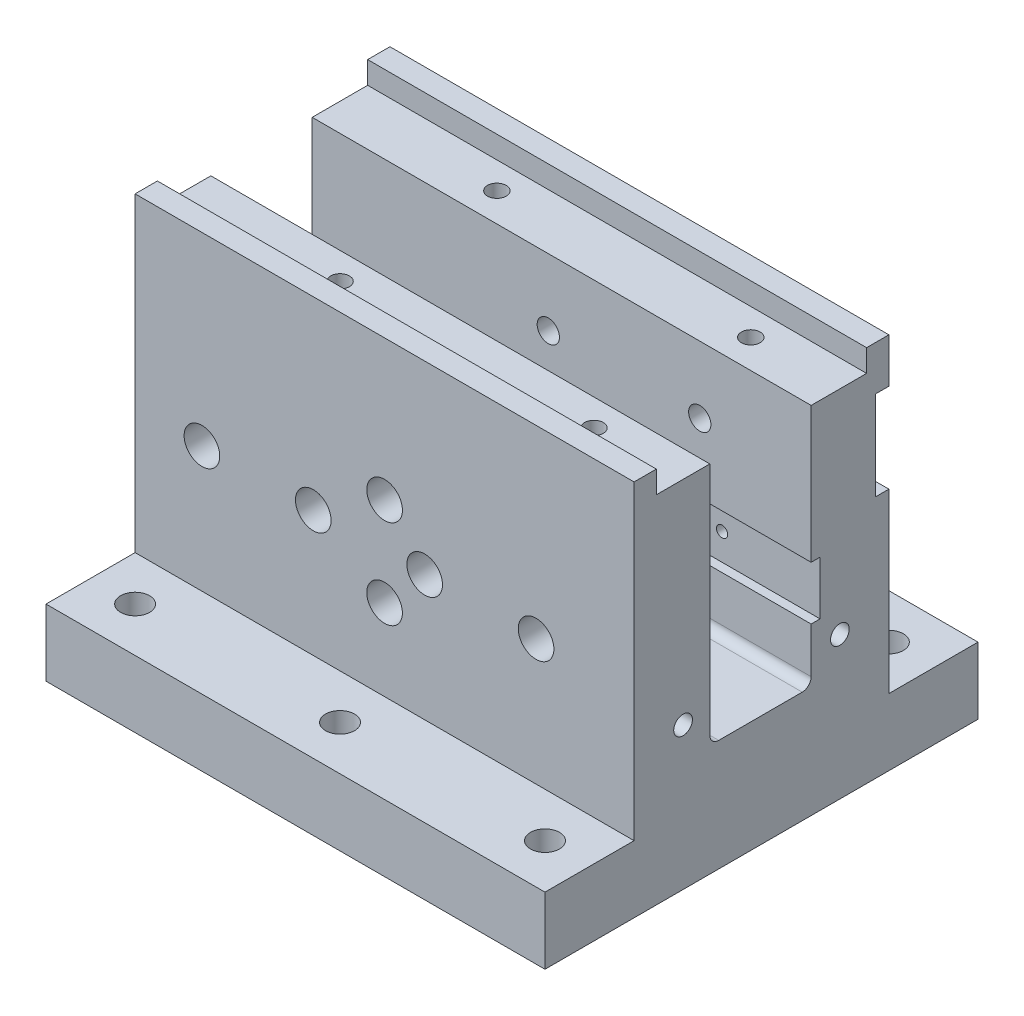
ISO-10303-21;
HEADER;
FILE_DESCRIPTION(('STEP AP214'),'2;1');
FILE_NAME('part.step','',(''),(''),'','','');
FILE_SCHEMA(('AUTOMOTIVE_DESIGN { 1 0 10303 214 1 1 1 1 }'));
ENDSEC;
DATA;
#1=APPLICATION_CONTEXT('core data for automotive mechanical design processes');
#2=APPLICATION_PROTOCOL_DEFINITION('international standard','automotive_design',2000,#1);
#3=PRODUCT_CONTEXT('',#1,'mechanical');
#4=PRODUCT('Part','Part','',(#3));
#5=PRODUCT_RELATED_PRODUCT_CATEGORY('part','',(#4));
#6=PRODUCT_DEFINITION_FORMATION('','',#4);
#7=PRODUCT_DEFINITION_CONTEXT('part definition',#1,'design');
#8=PRODUCT_DEFINITION('design','',#6,#7);
#9=PRODUCT_DEFINITION_SHAPE('','',#8);
#10=(LENGTH_UNIT() NAMED_UNIT(*) SI_UNIT(.MILLI.,.METRE.));
#11=(NAMED_UNIT(*) PLANE_ANGLE_UNIT() SI_UNIT($,.RADIAN.));
#12=(NAMED_UNIT(*) SI_UNIT($,.STERADIAN.) SOLID_ANGLE_UNIT());
#13=UNCERTAINTY_MEASURE_WITH_UNIT(LENGTH_MEASURE(1.E-05),#10,'distance_accuracy_value','');
#14=(GEOMETRIC_REPRESENTATION_CONTEXT(3) GLOBAL_UNCERTAINTY_ASSIGNED_CONTEXT((#13)) GLOBAL_UNIT_ASSIGNED_CONTEXT((#10,
#11,#12)) REPRESENTATION_CONTEXT('',''));
#15=CARTESIAN_POINT('',(0.,0.,0.));
#16=DIRECTION('',(0.,0.,1.));
#17=DIRECTION('',(1.,0.,0.));
#18=AXIS2_PLACEMENT_3D('',#15,#16,#17);
#19=CARTESIAN_POINT('',(0.,0.,97.2));
#20=DIRECTION('',(1.,0.,0.));
#21=DIRECTION('',(0.,0.,-1.));
#22=AXIS2_PLACEMENT_3D('',#19,#20,#21);
#23=PLANE('',#22);
#24=DIRECTION('',(0.,1.,0.));
#25=VECTOR('',#24,1.);
#26=CARTESIAN_POINT('',(0.,74.7400000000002,20.0000000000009));
#27=LINE('',#26,#25);
#28=CARTESIAN_POINT('',(0.,74.7400000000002,20.0000000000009));
#29=VERTEX_POINT('',#28);
#30=CARTESIAN_POINT('',(0.,84.7400000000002,20.0000000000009));
#31=VERTEX_POINT('',#30);
#32=EDGE_CURVE('E252',#29,#31,#27,.T.);
#33=ORIENTED_EDGE('',*,*,#32,.F.);
#34=DIRECTION('',(0.,0.,-1.));
#35=VECTOR('',#34,1.);
#36=CARTESIAN_POINT('',(0.,74.7400000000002,23.0000000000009));
#37=LINE('',#36,#35);
#38=CARTESIAN_POINT('',(0.,74.7400000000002,23.0000000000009));
#39=VERTEX_POINT('',#38);
#40=EDGE_CURVE('E249',#39,#29,#37,.T.);
#41=ORIENTED_EDGE('',*,*,#40,.F.);
#42=DIRECTION('',(0.,1.,0.));
#43=VECTOR('',#42,1.);
#44=CARTESIAN_POINT('',(0.,54.7400000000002,23.0000000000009));
#45=LINE('',#44,#43);
#46=CARTESIAN_POINT('',(0.,54.7400000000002,23.0000000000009));
#47=VERTEX_POINT('',#46);
#48=EDGE_CURVE('E246',#47,#39,#45,.T.);
#49=ORIENTED_EDGE('',*,*,#48,.F.);
#50=DIRECTION('',(0.,0.,1.));
#51=VECTOR('',#50,1.);
#52=CARTESIAN_POINT('',(0.,54.7400000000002,23.0000000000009));
#53=LINE('',#52,#51);
#54=CARTESIAN_POINT('',(0.,54.7400000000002,20.0000000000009));
#55=VERTEX_POINT('',#54);
#56=EDGE_CURVE('E243',#55,#47,#53,.T.);
#57=ORIENTED_EDGE('',*,*,#56,.F.);
#58=DIRECTION('',(0.,1.,0.));
#59=VECTOR('',#58,1.);
#60=CARTESIAN_POINT('',(0.,15.,20.0000000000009));
#61=LINE('',#60,#59);
#62=CARTESIAN_POINT('',(0.,15.,20.0000000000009));
#63=VERTEX_POINT('',#62);
#64=EDGE_CURVE('E240',#63,#55,#61,.T.);
#65=ORIENTED_EDGE('',*,*,#64,.F.);
#66=DIRECTION('',(0.,0.,1.));
#67=VECTOR('',#66,1.);
#68=CARTESIAN_POINT('',(0.,15.,20.0000000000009));
#69=LINE('',#68,#67);
#70=CARTESIAN_POINT('',(0.,15.,0.));
#71=VERTEX_POINT('',#70);
#72=EDGE_CURVE('E237',#71,#63,#69,.T.);
#73=ORIENTED_EDGE('',*,*,#72,.F.);
#74=DIRECTION('',(0.,-1.,0.));
#75=VECTOR('',#74,1.);
#76=CARTESIAN_POINT('',(0.,0.,0.));
#77=LINE('',#76,#75);
#78=CARTESIAN_POINT('',(0.,0.,0.));
#79=VERTEX_POINT('',#78);
#80=EDGE_CURVE('E346',#71,#79,#77,.T.);
#81=ORIENTED_EDGE('',*,*,#80,.T.);
#82=DIRECTION('',(0.,0.,-1.));
#83=VECTOR('',#82,1.);
#84=CARTESIAN_POINT('',(0.,0.,97.2));
#85=LINE('',#84,#83);
#86=CARTESIAN_POINT('',(0.,0.,97.2));
#87=VERTEX_POINT('',#86);
#88=EDGE_CURVE('E12',#87,#79,#85,.T.);
#89=ORIENTED_EDGE('',*,*,#88,.F.);
#90=DIRECTION('',(0.,-1.,0.));
#91=VECTOR('',#90,1.);
#92=CARTESIAN_POINT('',(0.,0.,97.2));
#93=LINE('',#92,#91);
#94=CARTESIAN_POINT('',(0.,15.,97.2));
#95=VERTEX_POINT('',#94);
#96=EDGE_CURVE('E393',#95,#87,#93,.T.);
#97=ORIENTED_EDGE('',*,*,#96,.F.);
#98=DIRECTION('',(0.,0.,1.));
#99=VECTOR('',#98,1.);
#100=CARTESIAN_POINT('',(0.,15.,97.1999999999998));
#101=LINE('',#100,#99);
#102=CARTESIAN_POINT('',(0.,15.,77.1999999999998));
#103=VERTEX_POINT('',#102);
#104=EDGE_CURVE('E57',#103,#95,#101,.T.);
#105=ORIENTED_EDGE('',*,*,#104,.F.);
#106=DIRECTION('',(0.,-1.,0.));
#107=VECTOR('',#106,1.);
#108=CARTESIAN_POINT('',(0.,15.,77.1999999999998));
#109=LINE('',#108,#107);
#110=CARTESIAN_POINT('',(0.,84.7400000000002,77.1999999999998));
#111=VERTEX_POINT('',#110);
#112=EDGE_CURVE('E230',#111,#103,#109,.T.);
#113=ORIENTED_EDGE('',*,*,#112,.F.);
#114=DIRECTION('',(0.,0.,-1.));
#115=VECTOR('',#114,1.);
#116=CARTESIAN_POINT('',(0.,84.7400000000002,97.2));
#117=LINE('',#116,#115);
#118=CARTESIAN_POINT('',(0.,84.7400000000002,72.1999999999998));
#119=VERTEX_POINT('',#118);
#120=EDGE_CURVE('E229',#111,#119,#117,.T.);
#121=ORIENTED_EDGE('',*,*,#120,.T.);
#122=DIRECTION('',(0.,1.,0.));
#123=VECTOR('',#122,1.);
#124=CARTESIAN_POINT('',(0.,79.7400000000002,72.1999999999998));
#125=LINE('',#124,#123);
#126=CARTESIAN_POINT('',(0.,79.7400000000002,72.1999999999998));
#127=VERTEX_POINT('',#126);
#128=EDGE_CURVE('E49',#127,#119,#125,.T.);
#129=ORIENTED_EDGE('',*,*,#128,.F.);
#130=DIRECTION('',(0.,0.,1.));
#131=VECTOR('',#130,1.);
#132=CARTESIAN_POINT('',(0.,79.7400000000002,72.1999999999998));
#133=LINE('',#132,#131);
#134=CARTESIAN_POINT('',(0.,79.7400000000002,60.1999999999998));
#135=VERTEX_POINT('',#134);
#136=EDGE_CURVE('E217',#135,#127,#133,.T.);
#137=ORIENTED_EDGE('',*,*,#136,.F.);
#138=DIRECTION('',(0.,1.,0.));
#139=VECTOR('',#138,1.);
#140=CARTESIAN_POINT('',(0.,26.9999999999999,60.1999999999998));
#141=LINE('',#140,#139);
#142=CARTESIAN_POINT('',(0.,26.9999999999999,60.1999999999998));
#143=VERTEX_POINT('',#142);
#144=EDGE_CURVE('E214',#143,#135,#141,.T.);
#145=ORIENTED_EDGE('',*,*,#144,.F.);
#146=CARTESIAN_POINT('',(0.,26.9999999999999,58.1999999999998));
#147=DIRECTION('',(-1.,0.,0.));
#148=DIRECTION('',(0.,0.,-1.));
#149=AXIS2_PLACEMENT_3D('',#146,#147,#148);
#150=CIRCLE('',#149,2.);
#151=CARTESIAN_POINT('',(0.,24.9999999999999,58.1999999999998));
#152=VERTEX_POINT('',#151);
#153=EDGE_CURVE('E281',#152,#143,#150,.T.);
#154=ORIENTED_EDGE('',*,*,#153,.F.);
#155=DIRECTION('',(0.,0.,1.));
#156=VECTOR('',#155,1.);
#157=CARTESIAN_POINT('',(0.,24.9999999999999,58.1999999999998));
#158=LINE('',#157,#156);
#159=CARTESIAN_POINT('',(0.,24.9999999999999,39.4499999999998));
#160=VERTEX_POINT('',#159);
#161=EDGE_CURVE('E278',#160,#152,#158,.T.);
#162=ORIENTED_EDGE('',*,*,#161,.F.);
#163=CARTESIAN_POINT('',(0.,26.9999999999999,39.4499999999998));
#164=DIRECTION('',(-1.,0.,0.));
#165=DIRECTION('',(0.,0.,-1.));
#166=AXIS2_PLACEMENT_3D('',#163,#164,#165);
#167=CIRCLE('',#166,2.);
#168=CARTESIAN_POINT('',(0.,26.9999999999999,37.4499999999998));
#169=VERTEX_POINT('',#168);
#170=EDGE_CURVE('E275',#169,#160,#167,.T.);
#171=ORIENTED_EDGE('',*,*,#170,.F.);
#172=DIRECTION('',(0.,-1.,0.));
#173=VECTOR('',#172,1.);
#174=CARTESIAN_POINT('',(0.,26.9999999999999,37.4499999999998));
#175=LINE('',#174,#173);
#176=CARTESIAN_POINT('',(0.,37.2399999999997,37.4499999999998));
#177=VERTEX_POINT('',#176);
#178=EDGE_CURVE('E272',#177,#169,#175,.T.);
#179=ORIENTED_EDGE('',*,*,#178,.F.);
#180=DIRECTION('',(0.,0.,1.));
#181=VECTOR('',#180,1.);
#182=CARTESIAN_POINT('',(0.,37.2399999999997,37.4499999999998));
#183=LINE('',#182,#181);
#184=CARTESIAN_POINT('',(0.,37.2399999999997,35.4499999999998));
#185=VERTEX_POINT('',#184);
#186=EDGE_CURVE('E269',#185,#177,#183,.T.);
#187=ORIENTED_EDGE('',*,*,#186,.F.);
#188=DIRECTION('',(0.,-1.,0.));
#189=VECTOR('',#188,1.);
#190=CARTESIAN_POINT('',(0.,37.2399999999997,35.4499999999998));
#191=LINE('',#190,#189);
#192=CARTESIAN_POINT('',(0.,49.2399999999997,35.4499999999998));
#193=VERTEX_POINT('',#192);
#194=EDGE_CURVE('E266',#193,#185,#191,.T.);
#195=ORIENTED_EDGE('',*,*,#194,.F.);
#196=DIRECTION('',(0.,0.,-1.));
#197=VECTOR('',#196,1.);
#198=CARTESIAN_POINT('',(0.,49.2399999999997,37.4499999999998));
#199=LINE('',#198,#197);
#200=CARTESIAN_POINT('',(0.,49.2399999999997,37.4499999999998));
#201=VERTEX_POINT('',#200);
#202=EDGE_CURVE('E263',#201,#193,#199,.T.);
#203=ORIENTED_EDGE('',*,*,#202,.F.);
#204=DIRECTION('',(0.,-1.,0.));
#205=VECTOR('',#204,1.);
#206=CARTESIAN_POINT('',(0.,49.2399999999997,37.4499999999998));
#207=LINE('',#206,#205);
#208=CARTESIAN_POINT('',(0.,79.7400000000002,37.4499999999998));
#209=VERTEX_POINT('',#208);
#210=EDGE_CURVE('E260',#209,#201,#207,.T.);
#211=ORIENTED_EDGE('',*,*,#210,.F.);
#212=DIRECTION('',(0.,0.,1.));
#213=VECTOR('',#212,1.);
#214=CARTESIAN_POINT('',(0.,79.7400000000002,37.4499999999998));
#215=LINE('',#214,#213);
#216=CARTESIAN_POINT('',(0.,79.7400000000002,25.));
#217=VERTEX_POINT('',#216);
#218=EDGE_CURVE('E257',#217,#209,#215,.T.);
#219=ORIENTED_EDGE('',*,*,#218,.F.);
#220=DIRECTION('',(0.,-1.,0.));
#221=VECTOR('',#220,1.);
#222=CARTESIAN_POINT('',(0.,79.7400000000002,25.));
#223=LINE('',#222,#221);
#224=CARTESIAN_POINT('',(0.,84.7400000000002,25.));
#225=VERTEX_POINT('',#224);
#226=EDGE_CURVE('E254',#225,#217,#223,.T.);
#227=ORIENTED_EDGE('',*,*,#226,.F.);
#228=EDGE_CURVE('E401',#225,#31,#117,.T.);
#229=ORIENTED_EDGE('',*,*,#228,.T.);
#230=EDGE_LOOP('',(#33,#41,#49,#57,#65,#73,#81,#89,#97,#105,#113,#121,#129,#137,#145,#154,#162,
#171,#179,#187,#195,#203,#211,#219,#227,#229));
#231=FACE_BOUND('',#230,.T.);
#232=ADVANCED_FACE('F33',(#231),#23,.F.);
#233=CARTESIAN_POINT('',(112.,0.,97.2));
#234=DIRECTION('',(-1.,0.,0.));
#235=DIRECTION('',(0.,0.,1.));
#236=AXIS2_PLACEMENT_3D('',#233,#234,#235);
#237=PLANE('',#236);
#238=CARTESIAN_POINT('',(112.,31.9999999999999,31.0000000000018));
#239=DIRECTION('',(1.,0.,0.));
#240=DIRECTION('',(0.,0.,-1.));
#241=AXIS2_PLACEMENT_3D('',#238,#239,#240);
#242=CIRCLE('',#241,2.1);
#243=CARTESIAN_POINT('',(112.,31.9999999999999,28.9000000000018));
#244=VERTEX_POINT('',#243);
#245=EDGE_CURVE('E826',#244,#244,#242,.T.);
#246=ORIENTED_EDGE('',*,*,#245,.F.);
#247=EDGE_LOOP('',(#246));
#248=FACE_BOUND('',#247,.T.);
#249=CARTESIAN_POINT('',(112.,31.9999999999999,66.2000000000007));
#250=DIRECTION('',(1.,0.,0.));
#251=DIRECTION('',(0.,0.,-1.));
#252=AXIS2_PLACEMENT_3D('',#249,#250,#251);
#253=CIRCLE('',#252,2.1);
#254=CARTESIAN_POINT('',(112.,31.9999999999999,64.1000000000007));
#255=VERTEX_POINT('',#254);
#256=EDGE_CURVE('E825',#255,#255,#253,.T.);
#257=ORIENTED_EDGE('',*,*,#256,.F.);
#258=EDGE_LOOP('',(#257));
#259=FACE_BOUND('',#258,.T.);
#260=DIRECTION('',(0.,1.,0.));
#261=VECTOR('',#260,1.);
#262=CARTESIAN_POINT('',(112.,74.7400000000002,20.0000000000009));
#263=LINE('',#262,#261);
#264=CARTESIAN_POINT('',(112.,74.7400000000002,20.0000000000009));
#265=VERTEX_POINT('',#264);
#266=CARTESIAN_POINT('',(112.,84.7400000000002,20.0000000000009));
#267=VERTEX_POINT('',#266);
#268=EDGE_CURVE('E310',#265,#267,#263,.T.);
#269=ORIENTED_EDGE('',*,*,#268,.T.);
#270=DIRECTION('',(0.,0.,-1.));
#271=VECTOR('',#270,1.);
#272=CARTESIAN_POINT('',(112.,84.7400000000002,97.2));
#273=LINE('',#272,#271);
#274=CARTESIAN_POINT('',(112.,84.7400000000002,25.));
#275=VERTEX_POINT('',#274);
#276=EDGE_CURVE('E409',#275,#267,#273,.T.);
#277=ORIENTED_EDGE('',*,*,#276,.F.);
#278=DIRECTION('',(0.,-1.,0.));
#279=VECTOR('',#278,1.);
#280=CARTESIAN_POINT('',(112.,79.7400000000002,25.));
#281=LINE('',#280,#279);
#282=CARTESIAN_POINT('',(112.,79.7400000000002,25.));
#283=VERTEX_POINT('',#282);
#284=EDGE_CURVE('E313',#275,#283,#281,.T.);
#285=ORIENTED_EDGE('',*,*,#284,.T.);
#286=DIRECTION('',(0.,0.,1.));
#287=VECTOR('',#286,1.);
#288=CARTESIAN_POINT('',(112.,79.7400000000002,37.4499999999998));
#289=LINE('',#288,#287);
#290=CARTESIAN_POINT('',(112.,79.7400000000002,37.4499999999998));
#291=VERTEX_POINT('',#290);
#292=EDGE_CURVE('E316',#283,#291,#289,.T.);
#293=ORIENTED_EDGE('',*,*,#292,.T.);
#294=DIRECTION('',(0.,-1.,0.));
#295=VECTOR('',#294,1.);
#296=CARTESIAN_POINT('',(112.,49.2399999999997,37.4499999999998));
#297=LINE('',#296,#295);
#298=CARTESIAN_POINT('',(112.,49.2399999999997,37.4499999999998));
#299=VERTEX_POINT('',#298);
#300=EDGE_CURVE('E319',#291,#299,#297,.T.);
#301=ORIENTED_EDGE('',*,*,#300,.T.);
#302=DIRECTION('',(0.,0.,-1.));
#303=VECTOR('',#302,1.);
#304=CARTESIAN_POINT('',(112.,49.2399999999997,37.4499999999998));
#305=LINE('',#304,#303);
#306=CARTESIAN_POINT('',(112.,49.2399999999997,35.4499999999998));
#307=VERTEX_POINT('',#306);
#308=EDGE_CURVE('E322',#299,#307,#305,.T.);
#309=ORIENTED_EDGE('',*,*,#308,.T.);
#310=DIRECTION('',(0.,-1.,0.));
#311=VECTOR('',#310,1.);
#312=CARTESIAN_POINT('',(112.,37.2399999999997,35.4499999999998));
#313=LINE('',#312,#311);
#314=CARTESIAN_POINT('',(112.,37.2399999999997,35.4499999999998));
#315=VERTEX_POINT('',#314);
#316=EDGE_CURVE('E325',#307,#315,#313,.T.);
#317=ORIENTED_EDGE('',*,*,#316,.T.);
#318=DIRECTION('',(0.,0.,1.));
#319=VECTOR('',#318,1.);
#320=CARTESIAN_POINT('',(112.,37.2399999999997,37.4499999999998));
#321=LINE('',#320,#319);
#322=CARTESIAN_POINT('',(112.,37.2399999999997,37.4499999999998));
#323=VERTEX_POINT('',#322);
#324=EDGE_CURVE('E328',#315,#323,#321,.T.);
#325=ORIENTED_EDGE('',*,*,#324,.T.);
#326=DIRECTION('',(0.,-1.,0.));
#327=VECTOR('',#326,1.);
#328=CARTESIAN_POINT('',(112.,26.9999999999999,37.4499999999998));
#329=LINE('',#328,#327);
#330=CARTESIAN_POINT('',(112.,26.9999999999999,37.4499999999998));
#331=VERTEX_POINT('',#330);
#332=EDGE_CURVE('E331',#323,#331,#329,.T.);
#333=ORIENTED_EDGE('',*,*,#332,.T.);
#334=CARTESIAN_POINT('',(112.,26.9999999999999,39.4499999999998));
#335=DIRECTION('',(-1.,0.,0.));
#336=DIRECTION('',(0.,0.,-1.));
#337=AXIS2_PLACEMENT_3D('',#334,#335,#336);
#338=CIRCLE('',#337,2.);
#339=CARTESIAN_POINT('',(112.,24.9999999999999,39.4499999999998));
#340=VERTEX_POINT('',#339);
#341=EDGE_CURVE('E334',#331,#340,#338,.T.);
#342=ORIENTED_EDGE('',*,*,#341,.T.);
#343=DIRECTION('',(0.,0.,1.));
#344=VECTOR('',#343,1.);
#345=CARTESIAN_POINT('',(112.,24.9999999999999,58.1999999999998));
#346=LINE('',#345,#344);
#347=CARTESIAN_POINT('',(112.,24.9999999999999,58.1999999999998));
#348=VERTEX_POINT('',#347);
#349=EDGE_CURVE('E337',#340,#348,#346,.T.);
#350=ORIENTED_EDGE('',*,*,#349,.T.);
#351=CARTESIAN_POINT('',(112.,26.9999999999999,58.1999999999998));
#352=DIRECTION('',(-1.,0.,0.));
#353=DIRECTION('',(0.,0.,-1.));
#354=AXIS2_PLACEMENT_3D('',#351,#352,#353);
#355=CIRCLE('',#354,2.);
#356=CARTESIAN_POINT('',(112.,26.9999999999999,60.1999999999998));
#357=VERTEX_POINT('',#356);
#358=EDGE_CURVE('E340',#348,#357,#355,.T.);
#359=ORIENTED_EDGE('',*,*,#358,.T.);
#360=DIRECTION('',(0.,1.,0.));
#361=VECTOR('',#360,1.);
#362=CARTESIAN_POINT('',(112.,26.9999999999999,60.1999999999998));
#363=LINE('',#362,#361);
#364=CARTESIAN_POINT('',(112.,79.7400000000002,60.1999999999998));
#365=VERTEX_POINT('',#364);
#366=EDGE_CURVE('E223',#357,#365,#363,.T.);
#367=ORIENTED_EDGE('',*,*,#366,.T.);
#368=DIRECTION('',(0.,0.,1.));
#369=VECTOR('',#368,1.);
#370=CARTESIAN_POINT('',(112.,79.7400000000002,72.1999999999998));
#371=LINE('',#370,#369);
#372=CARTESIAN_POINT('',(112.,79.7400000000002,72.1999999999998));
#373=VERTEX_POINT('',#372);
#374=EDGE_CURVE('E285',#365,#373,#371,.T.);
#375=ORIENTED_EDGE('',*,*,#374,.T.);
#376=DIRECTION('',(0.,1.,0.));
#377=VECTOR('',#376,1.);
#378=CARTESIAN_POINT('',(112.,79.7400000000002,72.1999999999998));
#379=LINE('',#378,#377);
#380=CARTESIAN_POINT('',(112.,84.7400000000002,72.1999999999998));
#381=VERTEX_POINT('',#380);
#382=EDGE_CURVE('E209',#373,#381,#379,.T.);
#383=ORIENTED_EDGE('',*,*,#382,.T.);
#384=CARTESIAN_POINT('',(112.,84.7400000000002,77.1999999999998));
#385=VERTEX_POINT('',#384);
#386=EDGE_CURVE('E412',#385,#381,#273,.T.);
#387=ORIENTED_EDGE('',*,*,#386,.F.);
#388=DIRECTION('',(0.,-1.,0.));
#389=VECTOR('',#388,1.);
#390=CARTESIAN_POINT('',(112.,15.,77.1999999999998));
#391=LINE('',#390,#389);
#392=CARTESIAN_POINT('',(112.,15.,77.1999999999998));
#393=VERTEX_POINT('',#392);
#394=EDGE_CURVE('E289',#385,#393,#391,.T.);
#395=ORIENTED_EDGE('',*,*,#394,.T.);
#396=DIRECTION('',(0.,0.,1.));
#397=VECTOR('',#396,1.);
#398=CARTESIAN_POINT('',(112.,15.,97.1999999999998));
#399=LINE('',#398,#397);
#400=CARTESIAN_POINT('',(112.,15.,97.1999999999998));
#401=VERTEX_POINT('',#400);
#402=EDGE_CURVE('E292',#393,#401,#399,.T.);
#403=ORIENTED_EDGE('',*,*,#402,.T.);
#404=DIRECTION('',(0.,1.,0.));
#405=VECTOR('',#404,1.);
#406=CARTESIAN_POINT('',(112.,0.,97.2));
#407=LINE('',#406,#405);
#408=CARTESIAN_POINT('',(112.,0.,97.2));
#409=VERTEX_POINT('',#408);
#410=EDGE_CURVE('E398',#409,#401,#407,.T.);
#411=ORIENTED_EDGE('',*,*,#410,.F.);
#412=DIRECTION('',(0.,0.,-1.));
#413=VECTOR('',#412,1.);
#414=CARTESIAN_POINT('',(112.,0.,97.2));
#415=LINE('',#414,#413);
#416=CARTESIAN_POINT('',(112.,0.,0.));
#417=VERTEX_POINT('',#416);
#418=EDGE_CURVE('E41',#409,#417,#415,.T.);
#419=ORIENTED_EDGE('',*,*,#418,.T.);
#420=DIRECTION('',(0.,1.,0.));
#421=VECTOR('',#420,1.);
#422=CARTESIAN_POINT('',(112.,0.,0.));
#423=LINE('',#422,#421);
#424=CARTESIAN_POINT('',(112.,15.,0.));
#425=VERTEX_POINT('',#424);
#426=EDGE_CURVE('E396',#417,#425,#423,.T.);
#427=ORIENTED_EDGE('',*,*,#426,.T.);
#428=DIRECTION('',(0.,0.,1.));
#429=VECTOR('',#428,1.);
#430=CARTESIAN_POINT('',(112.,15.,20.0000000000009));
#431=LINE('',#430,#429);
#432=CARTESIAN_POINT('',(112.,15.,20.0000000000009));
#433=VERTEX_POINT('',#432);
#434=EDGE_CURVE('E295',#425,#433,#431,.T.);
#435=ORIENTED_EDGE('',*,*,#434,.T.);
#436=DIRECTION('',(0.,1.,0.));
#437=VECTOR('',#436,1.);
#438=CARTESIAN_POINT('',(112.,15.,20.0000000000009));
#439=LINE('',#438,#437);
#440=CARTESIAN_POINT('',(112.,54.7400000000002,20.0000000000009));
#441=VERTEX_POINT('',#440);
#442=EDGE_CURVE('E298',#433,#441,#439,.T.);
#443=ORIENTED_EDGE('',*,*,#442,.T.);
#444=DIRECTION('',(0.,0.,1.));
#445=VECTOR('',#444,1.);
#446=CARTESIAN_POINT('',(112.,54.7400000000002,23.0000000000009));
#447=LINE('',#446,#445);
#448=CARTESIAN_POINT('',(112.,54.7400000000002,23.0000000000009));
#449=VERTEX_POINT('',#448);
#450=EDGE_CURVE('E301',#441,#449,#447,.T.);
#451=ORIENTED_EDGE('',*,*,#450,.T.);
#452=DIRECTION('',(0.,1.,0.));
#453=VECTOR('',#452,1.);
#454=CARTESIAN_POINT('',(112.,54.7400000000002,23.0000000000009));
#455=LINE('',#454,#453);
#456=CARTESIAN_POINT('',(112.,74.7400000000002,23.0000000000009));
#457=VERTEX_POINT('',#456);
#458=EDGE_CURVE('E304',#449,#457,#455,.T.);
#459=ORIENTED_EDGE('',*,*,#458,.T.);
#460=DIRECTION('',(0.,0.,-1.));
#461=VECTOR('',#460,1.);
#462=CARTESIAN_POINT('',(112.,74.7400000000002,23.0000000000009));
#463=LINE('',#462,#461);
#464=EDGE_CURVE('E307',#457,#265,#463,.T.);
#465=ORIENTED_EDGE('',*,*,#464,.T.);
#466=EDGE_LOOP('',(#269,#277,#285,#293,#301,#309,#317,#325,#333,#342,#350,#359,#367,#375,#383,
#387,#395,#403,#411,#419,#427,#435,#443,#451,#459,#465));
#467=FACE_BOUND('',#466,.T.);
#468=ADVANCED_FACE('F501',(#248,#259,#467),#237,.F.);
#469=CARTESIAN_POINT('',(0.,84.7400000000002,97.2));
#470=DIRECTION('',(0.,-1.,0.));
#471=DIRECTION('',(0.,0.,-1.));
#472=AXIS2_PLACEMENT_3D('',#469,#470,#471);
#473=PLANE('',#472);
#474=DIRECTION('',(1.,0.,0.));
#475=VECTOR('',#474,1.);
#476=CARTESIAN_POINT('',(0.,84.7400000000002,25.));
#477=LINE('',#476,#475);
#478=EDGE_CURVE('E367',#225,#275,#477,.T.);
#479=ORIENTED_EDGE('',*,*,#478,.T.);
#480=ORIENTED_EDGE('',*,*,#276,.T.);
#481=DIRECTION('',(1.,0.,0.));
#482=VECTOR('',#481,1.);
#483=CARTESIAN_POINT('',(0.,84.7400000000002,20.0000000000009));
#484=LINE('',#483,#482);
#485=EDGE_CURVE('E370',#31,#267,#484,.T.);
#486=ORIENTED_EDGE('',*,*,#485,.F.);
#487=ORIENTED_EDGE('',*,*,#228,.F.);
#488=EDGE_LOOP('',(#479,#480,#486,#487));
#489=FACE_BOUND('',#488,.T.);
#490=ADVANCED_FACE('F546',(#489),#473,.F.);
#491=DIRECTION('',(1.,0.,0.));
#492=VECTOR('',#491,1.);
#493=CARTESIAN_POINT('',(0.,84.7400000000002,77.1999999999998));
#494=LINE('',#493,#492);
#495=EDGE_CURVE('E389',#111,#385,#494,.T.);
#496=ORIENTED_EDGE('',*,*,#495,.T.);
#497=ORIENTED_EDGE('',*,*,#386,.T.);
#498=DIRECTION('',(1.,0.,0.));
#499=VECTOR('',#498,1.);
#500=CARTESIAN_POINT('',(0.,84.7400000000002,72.1999999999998));
#501=LINE('',#500,#499);
#502=EDGE_CURVE('E213',#119,#381,#501,.T.);
#503=ORIENTED_EDGE('',*,*,#502,.F.);
#504=ORIENTED_EDGE('',*,*,#120,.F.);
#505=EDGE_LOOP('',(#496,#497,#503,#504));
#506=FACE_BOUND('',#505,.T.);
#507=ADVANCED_FACE('F500',(#506),#473,.F.);
#508=CARTESIAN_POINT('',(0.,84.7400000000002,97.2));
#509=DIRECTION('',(0.,0.,-1.));
#510=DIRECTION('',(-1.,0.,0.));
#511=AXIS2_PLACEMENT_3D('',#508,#509,#510);
#512=PLANE('',#511);
#513=DIRECTION('',(1.,0.,0.));
#514=VECTOR('',#513,1.);
#515=CARTESIAN_POINT('',(0.,15.,97.1999999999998));
#516=LINE('',#515,#514);
#517=EDGE_CURVE('E385',#95,#401,#516,.T.);
#518=ORIENTED_EDGE('',*,*,#517,.F.);
#519=ORIENTED_EDGE('',*,*,#96,.T.);
#520=DIRECTION('',(1.,0.,0.));
#521=VECTOR('',#520,1.);
#522=CARTESIAN_POINT('',(0.,0.,97.2));
#523=LINE('',#522,#521);
#524=EDGE_CURVE('E395',#87,#409,#523,.T.);
#525=ORIENTED_EDGE('',*,*,#524,.T.);
#526=ORIENTED_EDGE('',*,*,#410,.T.);
#527=EDGE_LOOP('',(#518,#519,#525,#526));
#528=FACE_BOUND('',#527,.T.);
#529=ADVANCED_FACE('F581',(#528),#512,.F.);
#530=CARTESIAN_POINT('',(0.,84.7400000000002,0.));
#531=DIRECTION('',(0.,0.,-1.));
#532=DIRECTION('',(-1.,0.,0.));
#533=AXIS2_PLACEMENT_3D('',#530,#531,#532);
#534=PLANE('',#533);
#535=ORIENTED_EDGE('',*,*,#80,.F.);
#536=DIRECTION('',(1.,0.,0.));
#537=VECTOR('',#536,1.);
#538=CARTESIAN_POINT('',(0.,15.,0.));
#539=LINE('',#538,#537);
#540=EDGE_CURVE('E382',#71,#425,#539,.T.);
#541=ORIENTED_EDGE('',*,*,#540,.T.);
#542=ORIENTED_EDGE('',*,*,#426,.F.);
#543=DIRECTION('',(1.,0.,0.));
#544=VECTOR('',#543,1.);
#545=CARTESIAN_POINT('',(0.,0.,0.));
#546=LINE('',#545,#544);
#547=EDGE_CURVE('E403',#79,#417,#546,.T.);
#548=ORIENTED_EDGE('',*,*,#547,.F.);
#549=EDGE_LOOP('',(#535,#541,#542,#548));
#550=FACE_BOUND('',#549,.T.);
#551=ADVANCED_FACE('F573',(#550),#534,.T.);
#552=CARTESIAN_POINT('',(0.,0.,97.2));
#553=DIRECTION('',(0.,1.,0.));
#554=DIRECTION('',(0.,0.,1.));
#555=AXIS2_PLACEMENT_3D('',#552,#553,#554);
#556=PLANE('',#555);
#557=CARTESIAN_POINT('',(10.,0.,87.1999999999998));
#558=DIRECTION('',(0.,1.,0.));
#559=DIRECTION('',(0.,0.,1.));
#560=AXIS2_PLACEMENT_3D('',#557,#558,#559);
#561=CIRCLE('',#560,3.25);
#562=CARTESIAN_POINT('',(10.,0.,90.4499999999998));
#563=VERTEX_POINT('',#562);
#564=EDGE_CURVE('E861',#563,#563,#561,.T.);
#565=ORIENTED_EDGE('',*,*,#564,.T.);
#566=EDGE_LOOP('',(#565));
#567=FACE_BOUND('',#566,.T.);
#568=CARTESIAN_POINT('',(56.,0.,87.1999999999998));
#569=DIRECTION('',(0.,1.,0.));
#570=DIRECTION('',(0.,0.,1.));
#571=AXIS2_PLACEMENT_3D('',#568,#569,#570);
#572=CIRCLE('',#571,3.25);
#573=CARTESIAN_POINT('',(56.,0.,90.4499999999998));
#574=VERTEX_POINT('',#573);
#575=EDGE_CURVE('E638',#574,#574,#572,.T.);
#576=ORIENTED_EDGE('',*,*,#575,.T.);
#577=EDGE_LOOP('',(#576));
#578=FACE_BOUND('',#577,.T.);
#579=CARTESIAN_POINT('',(102.,0.,87.1999999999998));
#580=DIRECTION('',(0.,1.,0.));
#581=DIRECTION('',(0.,0.,1.));
#582=AXIS2_PLACEMENT_3D('',#579,#580,#581);
#583=CIRCLE('',#582,3.25);
#584=CARTESIAN_POINT('',(102.,0.,90.4499999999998));
#585=VERTEX_POINT('',#584);
#586=EDGE_CURVE('E637',#585,#585,#583,.T.);
#587=ORIENTED_EDGE('',*,*,#586,.T.);
#588=EDGE_LOOP('',(#587));
#589=FACE_BOUND('',#588,.T.);
#590=CARTESIAN_POINT('',(102.,0.,10.));
#591=DIRECTION('',(0.,1.,0.));
#592=DIRECTION('',(0.,0.,1.));
#593=AXIS2_PLACEMENT_3D('',#590,#591,#592);
#594=CIRCLE('',#593,3.25);
#595=CARTESIAN_POINT('',(102.,0.,13.25));
#596=VERTEX_POINT('',#595);
#597=EDGE_CURVE('E649',#596,#596,#594,.T.);
#598=ORIENTED_EDGE('',*,*,#597,.T.);
#599=EDGE_LOOP('',(#598));
#600=FACE_BOUND('',#599,.T.);
#601=CARTESIAN_POINT('',(56.,0.,10.));
#602=DIRECTION('',(0.,1.,0.));
#603=DIRECTION('',(0.,0.,1.));
#604=AXIS2_PLACEMENT_3D('',#601,#602,#603);
#605=CIRCLE('',#604,3.25);
#606=CARTESIAN_POINT('',(56.,0.,13.25));
#607=VERTEX_POINT('',#606);
#608=EDGE_CURVE('E655',#607,#607,#605,.T.);
#609=ORIENTED_EDGE('',*,*,#608,.T.);
#610=EDGE_LOOP('',(#609));
#611=FACE_BOUND('',#610,.T.);
#612=CARTESIAN_POINT('',(10.,0.,10.));
#613=DIRECTION('',(0.,1.,0.));
#614=DIRECTION('',(0.,0.,1.));
#615=AXIS2_PLACEMENT_3D('',#612,#613,#614);
#616=CIRCLE('',#615,3.25);
#617=CARTESIAN_POINT('',(10.,0.,13.25));
#618=VERTEX_POINT('',#617);
#619=EDGE_CURVE('E660',#618,#618,#616,.T.);
#620=ORIENTED_EDGE('',*,*,#619,.T.);
#621=EDGE_LOOP('',(#620));
#622=FACE_BOUND('',#621,.T.);
#623=ORIENTED_EDGE('',*,*,#547,.T.);
#624=ORIENTED_EDGE('',*,*,#418,.F.);
#625=ORIENTED_EDGE('',*,*,#524,.F.);
#626=ORIENTED_EDGE('',*,*,#88,.T.);
#627=EDGE_LOOP('',(#623,#624,#625,#626));
#628=FACE_BOUND('',#627,.T.);
#629=ADVANCED_FACE('F578',(#567,#578,#589,#600,#611,#622,#628),#556,.F.);
#630=CARTESIAN_POINT('',(0.,15.,20.0000000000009));
#631=DIRECTION('',(0.,1.,0.));
#632=DIRECTION('',(0.,0.,1.));
#633=AXIS2_PLACEMENT_3D('',#630,#631,#632);
#634=PLANE('',#633);
#635=CARTESIAN_POINT('',(102.,15.,10.));
#636=DIRECTION('',(0.,1.,0.));
#637=DIRECTION('',(0.,0.,1.));
#638=AXIS2_PLACEMENT_3D('',#635,#636,#637);
#639=CIRCLE('',#638,3.25);
#640=CARTESIAN_POINT('',(102.,15.,13.25));
#641=VERTEX_POINT('',#640);
#642=EDGE_CURVE('E641',#641,#641,#639,.T.);
#643=ORIENTED_EDGE('',*,*,#642,.F.);
#644=EDGE_LOOP('',(#643));
#645=FACE_BOUND('',#644,.T.);
#646=CARTESIAN_POINT('',(56.,15.,10.));
#647=DIRECTION('',(0.,1.,0.));
#648=DIRECTION('',(0.,0.,1.));
#649=AXIS2_PLACEMENT_3D('',#646,#647,#648);
#650=CIRCLE('',#649,3.25);
#651=CARTESIAN_POINT('',(56.,15.,13.25));
#652=VERTEX_POINT('',#651);
#653=EDGE_CURVE('E652',#652,#652,#650,.T.);
#654=ORIENTED_EDGE('',*,*,#653,.F.);
#655=EDGE_LOOP('',(#654));
#656=FACE_BOUND('',#655,.T.);
#657=CARTESIAN_POINT('',(10.,15.,10.));
#658=DIRECTION('',(0.,1.,0.));
#659=DIRECTION('',(0.,0.,1.));
#660=AXIS2_PLACEMENT_3D('',#657,#658,#659);
#661=CIRCLE('',#660,3.25);
#662=CARTESIAN_POINT('',(10.,15.,13.25));
#663=VERTEX_POINT('',#662);
#664=EDGE_CURVE('E658',#663,#663,#661,.T.);
#665=ORIENTED_EDGE('',*,*,#664,.F.);
#666=EDGE_LOOP('',(#665));
#667=FACE_BOUND('',#666,.T.);
#668=ORIENTED_EDGE('',*,*,#434,.F.);
#669=ORIENTED_EDGE('',*,*,#540,.F.);
#670=ORIENTED_EDGE('',*,*,#72,.T.);
#671=DIRECTION('',(1.,0.,0.));
#672=VECTOR('',#671,1.);
#673=CARTESIAN_POINT('',(0.,15.,20.0000000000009));
#674=LINE('',#673,#672);
#675=EDGE_CURVE('E380',#63,#433,#674,.T.);
#676=ORIENTED_EDGE('',*,*,#675,.T.);
#677=EDGE_LOOP('',(#668,#669,#670,#676));
#678=FACE_BOUND('',#677,.T.);
#679=ADVANCED_FACE('F583',(#645,#656,#667,#678),#634,.T.);
#680=CARTESIAN_POINT('',(0.,15.,20.0000000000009));
#681=DIRECTION('',(0.,0.,-1.));
#682=DIRECTION('',(-1.,0.,0.));
#683=AXIS2_PLACEMENT_3D('',#680,#681,#682);
#684=PLANE('',#683);
#685=CARTESIAN_POINT('',(90.0000000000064,43.2400000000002,20.0000000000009));
#686=DIRECTION('',(0.,0.,-1.));
#687=DIRECTION('',(-1.,0.,0.));
#688=AXIS2_PLACEMENT_3D('',#685,#686,#687);
#689=CIRCLE('',#688,1.25);
#690=CARTESIAN_POINT('',(88.7500000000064,43.2400000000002,20.0000000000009));
#691=VERTEX_POINT('',#690);
#692=EDGE_CURVE('E444',#691,#691,#689,.T.);
#693=ORIENTED_EDGE('',*,*,#692,.F.);
#694=EDGE_LOOP('',(#693));
#695=FACE_BOUND('',#694,.T.);
#696=CARTESIAN_POINT('',(65.0000000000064,43.2400000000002,20.0000000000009));
#697=DIRECTION('',(0.,0.,-1.));
#698=DIRECTION('',(-1.,0.,0.));
#699=AXIS2_PLACEMENT_3D('',#696,#697,#698);
#700=CIRCLE('',#699,1.25);
#701=CARTESIAN_POINT('',(63.7500000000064,43.2400000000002,20.0000000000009));
#702=VERTEX_POINT('',#701);
#703=EDGE_CURVE('E460',#702,#702,#700,.T.);
#704=ORIENTED_EDGE('',*,*,#703,.F.);
#705=EDGE_LOOP('',(#704));
#706=FACE_BOUND('',#705,.T.);
#707=CARTESIAN_POINT('',(15.0000000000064,43.2400000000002,20.0000000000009));
#708=DIRECTION('',(0.,0.,-1.));
#709=DIRECTION('',(-1.,0.,0.));
#710=AXIS2_PLACEMENT_3D('',#707,#708,#709);
#711=CIRCLE('',#710,1.25);
#712=CARTESIAN_POINT('',(13.7500000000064,43.2400000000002,20.0000000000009));
#713=VERTEX_POINT('',#712);
#714=EDGE_CURVE('E466',#713,#713,#711,.T.);
#715=ORIENTED_EDGE('',*,*,#714,.F.);
#716=EDGE_LOOP('',(#715));
#717=FACE_BOUND('',#716,.T.);
#718=CARTESIAN_POINT('',(40.0000000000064,43.2399999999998,20.0000000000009));
#719=DIRECTION('',(0.,0.,-1.));
#720=DIRECTION('',(-1.,0.,0.));
#721=AXIS2_PLACEMENT_3D('',#718,#719,#720);
#722=CIRCLE('',#721,1.25);
#723=CARTESIAN_POINT('',(38.7500000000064,43.2399999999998,20.0000000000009));
#724=VERTEX_POINT('',#723);
#725=EDGE_CURVE('E472',#724,#724,#722,.T.);
#726=ORIENTED_EDGE('',*,*,#725,.F.);
#727=EDGE_LOOP('',(#726));
#728=FACE_BOUND('',#727,.T.);
#729=ORIENTED_EDGE('',*,*,#442,.F.);
#730=ORIENTED_EDGE('',*,*,#675,.F.);
#731=ORIENTED_EDGE('',*,*,#64,.T.);
#732=DIRECTION('',(1.,0.,0.));
#733=VECTOR('',#732,1.);
#734=CARTESIAN_POINT('',(0.,54.7400000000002,20.0000000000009));
#735=LINE('',#734,#733);
#736=EDGE_CURVE('E378',#55,#441,#735,.T.);
#737=ORIENTED_EDGE('',*,*,#736,.T.);
#738=EDGE_LOOP('',(#729,#730,#731,#737));
#739=FACE_BOUND('',#738,.T.);
#740=ADVANCED_FACE('F566',(#695,#706,#717,#728,#739),#684,.T.);
#741=CARTESIAN_POINT('',(0.,54.7400000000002,23.0000000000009));
#742=DIRECTION('',(0.,1.,0.));
#743=DIRECTION('',(0.,0.,1.));
#744=AXIS2_PLACEMENT_3D('',#741,#742,#743);
#745=PLANE('',#744);
#746=ORIENTED_EDGE('',*,*,#450,.F.);
#747=ORIENTED_EDGE('',*,*,#736,.F.);
#748=ORIENTED_EDGE('',*,*,#56,.T.);
#749=DIRECTION('',(1.,0.,0.));
#750=VECTOR('',#749,1.);
#751=CARTESIAN_POINT('',(0.,54.7400000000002,23.0000000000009));
#752=LINE('',#751,#750);
#753=EDGE_CURVE('E376',#47,#449,#752,.T.);
#754=ORIENTED_EDGE('',*,*,#753,.T.);
#755=EDGE_LOOP('',(#746,#747,#748,#754));
#756=FACE_BOUND('',#755,.T.);
#757=ADVANCED_FACE('F563',(#756),#745,.T.);
#758=CARTESIAN_POINT('',(0.,54.7400000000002,23.0000000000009));
#759=DIRECTION('',(0.,0.,-1.));
#760=DIRECTION('',(-1.,0.,0.));
#761=AXIS2_PLACEMENT_3D('',#758,#759,#760);
#762=PLANE('',#761);
#763=CARTESIAN_POINT('',(53.0000000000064,64.7400000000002,23.0000000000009));
#764=DIRECTION('',(0.,0.,-1.));
#765=DIRECTION('',(-1.,0.,0.));
#766=AXIS2_PLACEMENT_3D('',#763,#764,#765);
#767=CIRCLE('',#766,2.50000000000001);
#768=CARTESIAN_POINT('',(50.5000000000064,64.7400000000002,23.0000000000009));
#769=VERTEX_POINT('',#768);
#770=EDGE_CURVE('E451',#769,#769,#767,.T.);
#771=ORIENTED_EDGE('',*,*,#770,.F.);
#772=EDGE_LOOP('',(#771));
#773=FACE_BOUND('',#772,.T.);
#774=CARTESIAN_POINT('',(87.0000000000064,64.7400000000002,23.0000000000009));
#775=DIRECTION('',(0.,0.,-1.));
#776=DIRECTION('',(-1.,0.,0.));
#777=AXIS2_PLACEMENT_3D('',#774,#775,#776);
#778=CIRCLE('',#777,2.50000000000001);
#779=CARTESIAN_POINT('',(84.5000000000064,64.7400000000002,23.0000000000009));
#780=VERTEX_POINT('',#779);
#781=EDGE_CURVE('E440',#780,#780,#778,.T.);
#782=ORIENTED_EDGE('',*,*,#781,.F.);
#783=EDGE_LOOP('',(#782));
#784=FACE_BOUND('',#783,.T.);
#785=ORIENTED_EDGE('',*,*,#458,.F.);
#786=ORIENTED_EDGE('',*,*,#753,.F.);
#787=ORIENTED_EDGE('',*,*,#48,.T.);
#788=DIRECTION('',(1.,0.,0.));
#789=VECTOR('',#788,1.);
#790=CARTESIAN_POINT('',(0.,74.7400000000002,23.0000000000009));
#791=LINE('',#790,#789);
#792=EDGE_CURVE('E374',#39,#457,#791,.T.);
#793=ORIENTED_EDGE('',*,*,#792,.T.);
#794=EDGE_LOOP('',(#785,#786,#787,#793));
#795=FACE_BOUND('',#794,.T.);
#796=ADVANCED_FACE('F560',(#773,#784,#795),#762,.T.);
#797=CARTESIAN_POINT('',(0.,74.7400000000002,20.0000000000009));
#798=DIRECTION('',(0.,0.,-1.));
#799=DIRECTION('',(-1.,0.,0.));
#800=AXIS2_PLACEMENT_3D('',#797,#798,#799);
#801=PLANE('',#800);
#802=ORIENTED_EDGE('',*,*,#268,.F.);
#803=DIRECTION('',(1.,0.,0.));
#804=VECTOR('',#803,1.);
#805=CARTESIAN_POINT('',(0.,74.7400000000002,20.0000000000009));
#806=LINE('',#805,#804);
#807=EDGE_CURVE('E372',#29,#265,#806,.T.);
#808=ORIENTED_EDGE('',*,*,#807,.F.);
#809=ORIENTED_EDGE('',*,*,#32,.T.);
#810=ORIENTED_EDGE('',*,*,#485,.T.);
#811=EDGE_LOOP('',(#802,#808,#809,#810));
#812=FACE_BOUND('',#811,.T.);
#813=ADVANCED_FACE('F550',(#812),#801,.T.);
#814=CARTESIAN_POINT('',(0.,74.7400000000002,23.0000000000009));
#815=DIRECTION('',(0.,-1.,0.));
#816=DIRECTION('',(0.,0.,-1.));
#817=AXIS2_PLACEMENT_3D('',#814,#815,#816);
#818=PLANE('',#817);
#819=ORIENTED_EDGE('',*,*,#464,.F.);
#820=ORIENTED_EDGE('',*,*,#792,.F.);
#821=ORIENTED_EDGE('',*,*,#40,.T.);
#822=ORIENTED_EDGE('',*,*,#807,.T.);
#823=EDGE_LOOP('',(#819,#820,#821,#822));
#824=FACE_BOUND('',#823,.T.);
#825=ADVANCED_FACE('F554',(#824),#818,.T.);
#826=CARTESIAN_POINT('',(0.,15.,97.1999999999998));
#827=DIRECTION('',(0.,1.,0.));
#828=DIRECTION('',(0.,0.,1.));
#829=AXIS2_PLACEMENT_3D('',#826,#827,#828);
#830=PLANE('',#829);
#831=CARTESIAN_POINT('',(10.,15.,87.1999999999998));
#832=DIRECTION('',(0.,1.,0.));
#833=DIRECTION('',(0.,0.,1.));
#834=AXIS2_PLACEMENT_3D('',#831,#832,#833);
#835=CIRCLE('',#834,3.25);
#836=CARTESIAN_POINT('',(10.,15.,90.4499999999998));
#837=VERTEX_POINT('',#836);
#838=EDGE_CURVE('E628',#837,#837,#835,.T.);
#839=ORIENTED_EDGE('',*,*,#838,.F.);
#840=EDGE_LOOP('',(#839));
#841=FACE_BOUND('',#840,.T.);
#842=CARTESIAN_POINT('',(56.,15.,87.1999999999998));
#843=DIRECTION('',(0.,1.,0.));
#844=DIRECTION('',(0.,0.,1.));
#845=AXIS2_PLACEMENT_3D('',#842,#843,#844);
#846=CIRCLE('',#845,3.25);
#847=CARTESIAN_POINT('',(56.,15.,90.4499999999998));
#848=VERTEX_POINT('',#847);
#849=EDGE_CURVE('E632',#848,#848,#846,.T.);
#850=ORIENTED_EDGE('',*,*,#849,.F.);
#851=EDGE_LOOP('',(#850));
#852=FACE_BOUND('',#851,.T.);
#853=CARTESIAN_POINT('',(102.,15.,87.1999999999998));
#854=DIRECTION('',(0.,1.,0.));
#855=DIRECTION('',(0.,0.,1.));
#856=AXIS2_PLACEMENT_3D('',#853,#854,#855);
#857=CIRCLE('',#856,3.25);
#858=CARTESIAN_POINT('',(102.,15.,90.4499999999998));
#859=VERTEX_POINT('',#858);
#860=EDGE_CURVE('E635',#859,#859,#857,.T.);
#861=ORIENTED_EDGE('',*,*,#860,.F.);
#862=EDGE_LOOP('',(#861));
#863=FACE_BOUND('',#862,.T.);
#864=ORIENTED_EDGE('',*,*,#402,.F.);
#865=DIRECTION('',(1.,0.,0.));
#866=VECTOR('',#865,1.);
#867=CARTESIAN_POINT('',(0.,15.,77.1999999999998));
#868=LINE('',#867,#866);
#869=EDGE_CURVE('E387',#103,#393,#868,.T.);
#870=ORIENTED_EDGE('',*,*,#869,.F.);
#871=ORIENTED_EDGE('',*,*,#104,.T.);
#872=ORIENTED_EDGE('',*,*,#517,.T.);
#873=EDGE_LOOP('',(#864,#870,#871,#872));
#874=FACE_BOUND('',#873,.T.);
#875=ADVANCED_FACE('F492',(#841,#852,#863,#874),#830,.T.);
#876=CARTESIAN_POINT('',(0.,15.,77.1999999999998));
#877=DIRECTION('',(0.,0.,1.));
#878=DIRECTION('',(1.,0.,0.));
#879=AXIS2_PLACEMENT_3D('',#876,#877,#878);
#880=PLANE('',#879);
#881=CARTESIAN_POINT('',(56.,33.2400000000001,77.1999999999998));
#882=DIRECTION('',(0.,0.,1.));
#883=DIRECTION('',(1.,0.,0.));
#884=AXIS2_PLACEMENT_3D('',#881,#882,#883);
#885=CIRCLE('',#884,4.);
#886=CARTESIAN_POINT('',(60.,33.2400000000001,77.1999999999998));
#887=VERTEX_POINT('',#886);
#888=EDGE_CURVE('E436',#887,#887,#885,.T.);
#889=ORIENTED_EDGE('',*,*,#888,.F.);
#890=EDGE_LOOP('',(#889));
#891=FACE_BOUND('',#890,.T.);
#892=CARTESIAN_POINT('',(56.,53.2400000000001,77.1999999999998));
#893=DIRECTION('',(0.,0.,1.));
#894=DIRECTION('',(1.,0.,0.));
#895=AXIS2_PLACEMENT_3D('',#892,#893,#894);
#896=CIRCLE('',#895,4.);
#897=CARTESIAN_POINT('',(60.,53.2400000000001,77.1999999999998));
#898=VERTEX_POINT('',#897);
#899=EDGE_CURVE('E433',#898,#898,#896,.T.);
#900=ORIENTED_EDGE('',*,*,#899,.F.);
#901=EDGE_LOOP('',(#900));
#902=FACE_BOUND('',#901,.T.);
#903=CARTESIAN_POINT('',(90.0000000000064,43.2399999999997,77.1999999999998));
#904=DIRECTION('',(0.,0.,1.));
#905=DIRECTION('',(1.,0.,0.));
#906=AXIS2_PLACEMENT_3D('',#903,#904,#905);
#907=CIRCLE('',#906,4.);
#908=CARTESIAN_POINT('',(94.0000000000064,43.2399999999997,77.1999999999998));
#909=VERTEX_POINT('',#908);
#910=EDGE_CURVE('E429',#909,#909,#907,.T.);
#911=ORIENTED_EDGE('',*,*,#910,.F.);
#912=EDGE_LOOP('',(#911));
#913=FACE_BOUND('',#912,.T.);
#914=CARTESIAN_POINT('',(65.0000000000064,43.2399999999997,77.1999999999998));
#915=DIRECTION('',(0.,0.,1.));
#916=DIRECTION('',(1.,0.,0.));
#917=AXIS2_PLACEMENT_3D('',#914,#915,#916);
#918=CIRCLE('',#917,4.);
#919=CARTESIAN_POINT('',(69.0000000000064,43.2399999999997,77.1999999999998));
#920=VERTEX_POINT('',#919);
#921=EDGE_CURVE('E425',#920,#920,#918,.T.);
#922=ORIENTED_EDGE('',*,*,#921,.F.);
#923=EDGE_LOOP('',(#922));
#924=FACE_BOUND('',#923,.T.);
#925=CARTESIAN_POINT('',(40.0000000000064,43.2399999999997,77.1999999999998));
#926=DIRECTION('',(0.,0.,1.));
#927=DIRECTION('',(1.,0.,0.));
#928=AXIS2_PLACEMENT_3D('',#925,#926,#927);
#929=CIRCLE('',#928,4.);
#930=CARTESIAN_POINT('',(44.0000000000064,43.2399999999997,77.1999999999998));
#931=VERTEX_POINT('',#930);
#932=EDGE_CURVE('E421',#931,#931,#929,.T.);
#933=ORIENTED_EDGE('',*,*,#932,.F.);
#934=EDGE_LOOP('',(#933));
#935=FACE_BOUND('',#934,.T.);
#936=CARTESIAN_POINT('',(15.0000000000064,43.2399999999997,77.1999999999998));
#937=DIRECTION('',(0.,0.,1.));
#938=DIRECTION('',(1.,0.,0.));
#939=AXIS2_PLACEMENT_3D('',#936,#937,#938);
#940=CIRCLE('',#939,4.);
#941=CARTESIAN_POINT('',(19.0000000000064,43.2399999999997,77.1999999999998));
#942=VERTEX_POINT('',#941);
#943=EDGE_CURVE('E417',#942,#942,#940,.T.);
#944=ORIENTED_EDGE('',*,*,#943,.F.);
#945=EDGE_LOOP('',(#944));
#946=FACE_BOUND('',#945,.T.);
#947=ORIENTED_EDGE('',*,*,#394,.F.);
#948=ORIENTED_EDGE('',*,*,#495,.F.);
#949=ORIENTED_EDGE('',*,*,#112,.T.);
#950=ORIENTED_EDGE('',*,*,#869,.T.);
#951=EDGE_LOOP('',(#947,#948,#949,#950));
#952=FACE_BOUND('',#951,.T.);
#953=ADVANCED_FACE('F489',(#891,#902,#913,#924,#935,#946,#952),#880,.T.);
#954=CARTESIAN_POINT('',(0.,79.7400000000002,72.1999999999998));
#955=DIRECTION('',(0.,1.,0.));
#956=DIRECTION('',(0.,0.,1.));
#957=AXIS2_PLACEMENT_3D('',#954,#955,#956);
#958=PLANE('',#957);
#959=CARTESIAN_POINT('',(35.,79.7400000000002,66.1999999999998));
#960=DIRECTION('',(0.,1.,0.));
#961=DIRECTION('',(0.,0.,1.));
#962=AXIS2_PLACEMENT_3D('',#959,#960,#961);
#963=CIRCLE('',#962,2.1);
#964=CARTESIAN_POINT('',(35.,79.7400000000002,68.2999999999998));
#965=VERTEX_POINT('',#964);
#966=EDGE_CURVE('E835',#965,#965,#963,.T.);
#967=ORIENTED_EDGE('',*,*,#966,.F.);
#968=EDGE_LOOP('',(#967));
#969=FACE_BOUND('',#968,.T.);
#970=CARTESIAN_POINT('',(92.,79.7400000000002,66.1999999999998));
#971=DIRECTION('',(0.,1.,0.));
#972=DIRECTION('',(0.,0.,1.));
#973=AXIS2_PLACEMENT_3D('',#970,#971,#972);
#974=CIRCLE('',#973,2.1);
#975=CARTESIAN_POINT('',(92.,79.7400000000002,68.2999999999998));
#976=VERTEX_POINT('',#975);
#977=EDGE_CURVE('E840',#976,#976,#974,.T.);
#978=ORIENTED_EDGE('',*,*,#977,.F.);
#979=EDGE_LOOP('',(#978));
#980=FACE_BOUND('',#979,.T.);
#981=ORIENTED_EDGE('',*,*,#374,.F.);
#982=DIRECTION('',(1.,0.,0.));
#983=VECTOR('',#982,1.);
#984=CARTESIAN_POINT('',(0.,79.7400000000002,60.1999999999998));
#985=LINE('',#984,#983);
#986=EDGE_CURVE('E219',#135,#365,#985,.T.);
#987=ORIENTED_EDGE('',*,*,#986,.F.);
#988=ORIENTED_EDGE('',*,*,#136,.T.);
#989=DIRECTION('',(1.,0.,0.));
#990=VECTOR('',#989,1.);
#991=CARTESIAN_POINT('',(0.,79.7400000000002,72.1999999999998));
#992=LINE('',#991,#990);
#993=EDGE_CURVE('E205',#127,#373,#992,.T.);
#994=ORIENTED_EDGE('',*,*,#993,.T.);
#995=EDGE_LOOP('',(#981,#987,#988,#994));
#996=FACE_BOUND('',#995,.T.);
#997=ADVANCED_FACE('F218',(#969,#980,#996),#958,.T.);
#998=CARTESIAN_POINT('',(0.,26.9999999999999,60.1999999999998));
#999=DIRECTION('',(0.,0.,-1.));
#1000=DIRECTION('',(-1.,0.,0.));
#1001=AXIS2_PLACEMENT_3D('',#998,#999,#1000);
#1002=PLANE('',#1001);
#1003=CARTESIAN_POINT('',(56.,33.2400000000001,60.1999999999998));
#1004=DIRECTION('',(0.,0.,-1.));
#1005=DIRECTION('',(-1.,0.,0.));
#1006=AXIS2_PLACEMENT_3D('',#1003,#1004,#1005);
#1007=CIRCLE('',#1006,4.);
#1008=CARTESIAN_POINT('',(52.,33.2400000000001,60.1999999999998));
#1009=VERTEX_POINT('',#1008);
#1010=EDGE_CURVE('E434',#1009,#1009,#1007,.T.);
#1011=ORIENTED_EDGE('',*,*,#1010,.F.);
#1012=EDGE_LOOP('',(#1011));
#1013=FACE_BOUND('',#1012,.T.);
#1014=CARTESIAN_POINT('',(56.,53.2400000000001,60.1999999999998));
#1015=DIRECTION('',(0.,0.,-1.));
#1016=DIRECTION('',(-1.,0.,0.));
#1017=AXIS2_PLACEMENT_3D('',#1014,#1015,#1016);
#1018=CIRCLE('',#1017,4.);
#1019=CARTESIAN_POINT('',(52.,53.2400000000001,60.1999999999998));
#1020=VERTEX_POINT('',#1019);
#1021=EDGE_CURVE('E430',#1020,#1020,#1018,.T.);
#1022=ORIENTED_EDGE('',*,*,#1021,.F.);
#1023=EDGE_LOOP('',(#1022));
#1024=FACE_BOUND('',#1023,.T.);
#1025=CARTESIAN_POINT('',(90.0000000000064,43.2399999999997,60.1999999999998));
#1026=DIRECTION('',(0.,0.,-1.));
#1027=DIRECTION('',(-1.,0.,0.));
#1028=AXIS2_PLACEMENT_3D('',#1025,#1026,#1027);
#1029=CIRCLE('',#1028,4.);
#1030=CARTESIAN_POINT('',(86.0000000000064,43.2399999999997,60.1999999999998));
#1031=VERTEX_POINT('',#1030);
#1032=EDGE_CURVE('E426',#1031,#1031,#1029,.T.);
#1033=ORIENTED_EDGE('',*,*,#1032,.F.);
#1034=EDGE_LOOP('',(#1033));
#1035=FACE_BOUND('',#1034,.T.);
#1036=CARTESIAN_POINT('',(65.0000000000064,43.2399999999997,60.1999999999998));
#1037=DIRECTION('',(0.,0.,-1.));
#1038=DIRECTION('',(-1.,0.,0.));
#1039=AXIS2_PLACEMENT_3D('',#1036,#1037,#1038);
#1040=CIRCLE('',#1039,4.);
#1041=CARTESIAN_POINT('',(61.0000000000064,43.2399999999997,60.1999999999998));
#1042=VERTEX_POINT('',#1041);
#1043=EDGE_CURVE('E422',#1042,#1042,#1040,.T.);
#1044=ORIENTED_EDGE('',*,*,#1043,.F.);
#1045=EDGE_LOOP('',(#1044));
#1046=FACE_BOUND('',#1045,.T.);
#1047=CARTESIAN_POINT('',(40.0000000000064,43.2399999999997,60.1999999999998));
#1048=DIRECTION('',(0.,0.,-1.));
#1049=DIRECTION('',(-1.,0.,0.));
#1050=AXIS2_PLACEMENT_3D('',#1047,#1048,#1049);
#1051=CIRCLE('',#1050,4.);
#1052=CARTESIAN_POINT('',(36.0000000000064,43.2399999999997,60.1999999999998));
#1053=VERTEX_POINT('',#1052);
#1054=EDGE_CURVE('E418',#1053,#1053,#1051,.T.);
#1055=ORIENTED_EDGE('',*,*,#1054,.F.);
#1056=EDGE_LOOP('',(#1055));
#1057=FACE_BOUND('',#1056,.T.);
#1058=CARTESIAN_POINT('',(15.0000000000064,43.2399999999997,60.1999999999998));
#1059=DIRECTION('',(0.,0.,-1.));
#1060=DIRECTION('',(-1.,0.,0.));
#1061=AXIS2_PLACEMENT_3D('',#1058,#1059,#1060);
#1062=CIRCLE('',#1061,4.);
#1063=CARTESIAN_POINT('',(11.0000000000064,43.2399999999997,60.1999999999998));
#1064=VERTEX_POINT('',#1063);
#1065=EDGE_CURVE('E287',#1064,#1064,#1062,.T.);
#1066=ORIENTED_EDGE('',*,*,#1065,.F.);
#1067=EDGE_LOOP('',(#1066));
#1068=FACE_BOUND('',#1067,.T.);
#1069=ORIENTED_EDGE('',*,*,#366,.F.);
#1070=DIRECTION('',(1.,0.,0.));
#1071=VECTOR('',#1070,1.);
#1072=CARTESIAN_POINT('',(0.,26.9999999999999,60.1999999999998));
#1073=LINE('',#1072,#1071);
#1074=EDGE_CURVE('E347',#143,#357,#1073,.T.);
#1075=ORIENTED_EDGE('',*,*,#1074,.F.);
#1076=ORIENTED_EDGE('',*,*,#144,.T.);
#1077=ORIENTED_EDGE('',*,*,#986,.T.);
#1078=EDGE_LOOP('',(#1069,#1075,#1076,#1077));
#1079=FACE_BOUND('',#1078,.T.);
#1080=ADVANCED_FACE('F505',(#1013,#1024,#1035,#1046,#1057,#1068,#1079),#1002,.T.);
#1081=CARTESIAN_POINT('',(0.,26.9999999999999,58.1999999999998));
#1082=DIRECTION('',(1.,0.,0.));
#1083=DIRECTION('',(0.,0.,-1.));
#1084=AXIS2_PLACEMENT_3D('',#1081,#1082,#1083);
#1085=CYLINDRICAL_SURFACE('',#1084,2.);
#1086=ORIENTED_EDGE('',*,*,#358,.F.);
#1087=DIRECTION('',(1.,0.,0.));
#1088=VECTOR('',#1087,1.);
#1089=CARTESIAN_POINT('',(0.,24.9999999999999,58.1999999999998));
#1090=LINE('',#1089,#1088);
#1091=EDGE_CURVE('E349',#152,#348,#1090,.T.);
#1092=ORIENTED_EDGE('',*,*,#1091,.F.);
#1093=ORIENTED_EDGE('',*,*,#153,.T.);
#1094=ORIENTED_EDGE('',*,*,#1074,.T.);
#1095=EDGE_LOOP('',(#1086,#1092,#1093,#1094));
#1096=FACE_BOUND('',#1095,.T.);
#1097=ADVANCED_FACE('F510',(#1096),#1085,.F.);
#1098=CARTESIAN_POINT('',(0.,24.9999999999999,58.1999999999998));
#1099=DIRECTION('',(0.,1.,0.));
#1100=DIRECTION('',(0.,0.,1.));
#1101=AXIS2_PLACEMENT_3D('',#1098,#1099,#1100);
#1102=PLANE('',#1101);
#1103=ORIENTED_EDGE('',*,*,#349,.F.);
#1104=DIRECTION('',(1.,0.,0.));
#1105=VECTOR('',#1104,1.);
#1106=CARTESIAN_POINT('',(0.,24.9999999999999,39.4499999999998));
#1107=LINE('',#1106,#1105);
#1108=EDGE_CURVE('E351',#160,#340,#1107,.T.);
#1109=ORIENTED_EDGE('',*,*,#1108,.F.);
#1110=ORIENTED_EDGE('',*,*,#161,.T.);
#1111=ORIENTED_EDGE('',*,*,#1091,.T.);
#1112=EDGE_LOOP('',(#1103,#1109,#1110,#1111));
#1113=FACE_BOUND('',#1112,.T.);
#1114=ADVANCED_FACE('F513',(#1113),#1102,.T.);
#1115=CARTESIAN_POINT('',(0.,26.9999999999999,39.4499999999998));
#1116=DIRECTION('',(1.,0.,0.));
#1117=DIRECTION('',(0.,0.,-1.));
#1118=AXIS2_PLACEMENT_3D('',#1115,#1116,#1117);
#1119=CYLINDRICAL_SURFACE('',#1118,2.);
#1120=ORIENTED_EDGE('',*,*,#341,.F.);
#1121=DIRECTION('',(1.,0.,0.));
#1122=VECTOR('',#1121,1.);
#1123=CARTESIAN_POINT('',(0.,26.9999999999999,37.4499999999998));
#1124=LINE('',#1123,#1122);
#1125=EDGE_CURVE('E353',#169,#331,#1124,.T.);
#1126=ORIENTED_EDGE('',*,*,#1125,.F.);
#1127=ORIENTED_EDGE('',*,*,#170,.T.);
#1128=ORIENTED_EDGE('',*,*,#1108,.T.);
#1129=EDGE_LOOP('',(#1120,#1126,#1127,#1128));
#1130=FACE_BOUND('',#1129,.T.);
#1131=ADVANCED_FACE('F516',(#1130),#1119,.F.);
#1132=CARTESIAN_POINT('',(0.,26.9999999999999,37.4499999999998));
#1133=DIRECTION('',(0.,0.,1.));
#1134=DIRECTION('',(1.,0.,0.));
#1135=AXIS2_PLACEMENT_3D('',#1132,#1133,#1134);
#1136=PLANE('',#1135);
#1137=ORIENTED_EDGE('',*,*,#332,.F.);
#1138=DIRECTION('',(1.,0.,0.));
#1139=VECTOR('',#1138,1.);
#1140=CARTESIAN_POINT('',(0.,37.2399999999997,37.4499999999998));
#1141=LINE('',#1140,#1139);
#1142=EDGE_CURVE('E355',#177,#323,#1141,.T.);
#1143=ORIENTED_EDGE('',*,*,#1142,.F.);
#1144=ORIENTED_EDGE('',*,*,#178,.T.);
#1145=ORIENTED_EDGE('',*,*,#1125,.T.);
#1146=EDGE_LOOP('',(#1137,#1143,#1144,#1145));
#1147=FACE_BOUND('',#1146,.T.);
#1148=ADVANCED_FACE('F522',(#1147),#1136,.T.);
#1149=CARTESIAN_POINT('',(0.,37.2399999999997,37.4499999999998));
#1150=DIRECTION('',(0.,1.,0.));
#1151=DIRECTION('',(0.,0.,1.));
#1152=AXIS2_PLACEMENT_3D('',#1149,#1150,#1151);
#1153=PLANE('',#1152);
#1154=ORIENTED_EDGE('',*,*,#324,.F.);
#1155=DIRECTION('',(1.,0.,0.));
#1156=VECTOR('',#1155,1.);
#1157=CARTESIAN_POINT('',(0.,37.2399999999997,35.4499999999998));
#1158=LINE('',#1157,#1156);
#1159=EDGE_CURVE('E357',#185,#315,#1158,.T.);
#1160=ORIENTED_EDGE('',*,*,#1159,.F.);
#1161=ORIENTED_EDGE('',*,*,#186,.T.);
#1162=ORIENTED_EDGE('',*,*,#1142,.T.);
#1163=EDGE_LOOP('',(#1154,#1160,#1161,#1162));
#1164=FACE_BOUND('',#1163,.T.);
#1165=ADVANCED_FACE('F525',(#1164),#1153,.T.);
#1166=CARTESIAN_POINT('',(0.,37.2399999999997,35.4499999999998));
#1167=DIRECTION('',(0.,0.,1.));
#1168=DIRECTION('',(1.,0.,0.));
#1169=AXIS2_PLACEMENT_3D('',#1166,#1167,#1168);
#1170=PLANE('',#1169);
#1171=CARTESIAN_POINT('',(90.0000000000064,43.2400000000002,35.4499999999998));
#1172=DIRECTION('',(0.,0.,1.));
#1173=DIRECTION('',(1.,0.,0.));
#1174=AXIS2_PLACEMENT_3D('',#1171,#1172,#1173);
#1175=CIRCLE('',#1174,1.25);
#1176=CARTESIAN_POINT('',(91.2500000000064,43.2400000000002,35.4499999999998));
#1177=VERTEX_POINT('',#1176);
#1178=EDGE_CURVE('E439',#1177,#1177,#1175,.T.);
#1179=ORIENTED_EDGE('',*,*,#1178,.F.);
#1180=EDGE_LOOP('',(#1179));
#1181=FACE_BOUND('',#1180,.T.);
#1182=CARTESIAN_POINT('',(65.0000000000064,43.2400000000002,35.4499999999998));
#1183=DIRECTION('',(0.,0.,1.));
#1184=DIRECTION('',(1.,0.,0.));
#1185=AXIS2_PLACEMENT_3D('',#1182,#1183,#1184);
#1186=CIRCLE('',#1185,1.25);
#1187=CARTESIAN_POINT('',(66.2500000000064,43.2400000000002,35.4499999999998));
#1188=VERTEX_POINT('',#1187);
#1189=EDGE_CURVE('E457',#1188,#1188,#1186,.T.);
#1190=ORIENTED_EDGE('',*,*,#1189,.F.);
#1191=EDGE_LOOP('',(#1190));
#1192=FACE_BOUND('',#1191,.T.);
#1193=CARTESIAN_POINT('',(15.0000000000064,43.2400000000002,35.4499999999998));
#1194=DIRECTION('',(0.,0.,1.));
#1195=DIRECTION('',(1.,0.,0.));
#1196=AXIS2_PLACEMENT_3D('',#1193,#1194,#1195);
#1197=CIRCLE('',#1196,1.25);
#1198=CARTESIAN_POINT('',(16.2500000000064,43.2400000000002,35.4499999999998));
#1199=VERTEX_POINT('',#1198);
#1200=EDGE_CURVE('E463',#1199,#1199,#1197,.T.);
#1201=ORIENTED_EDGE('',*,*,#1200,.F.);
#1202=EDGE_LOOP('',(#1201));
#1203=FACE_BOUND('',#1202,.T.);
#1204=CARTESIAN_POINT('',(40.0000000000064,43.2399999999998,35.4499999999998));
#1205=DIRECTION('',(0.,0.,1.));
#1206=DIRECTION('',(1.,0.,0.));
#1207=AXIS2_PLACEMENT_3D('',#1204,#1205,#1206);
#1208=CIRCLE('',#1207,1.25);
#1209=CARTESIAN_POINT('',(41.2500000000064,43.2399999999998,35.4499999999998));
#1210=VERTEX_POINT('',#1209);
#1211=EDGE_CURVE('E469',#1210,#1210,#1208,.T.);
#1212=ORIENTED_EDGE('',*,*,#1211,.F.);
#1213=EDGE_LOOP('',(#1212));
#1214=FACE_BOUND('',#1213,.T.);
#1215=ORIENTED_EDGE('',*,*,#316,.F.);
#1216=DIRECTION('',(1.,0.,0.));
#1217=VECTOR('',#1216,1.);
#1218=CARTESIAN_POINT('',(0.,49.2399999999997,35.4499999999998));
#1219=LINE('',#1218,#1217);
#1220=EDGE_CURVE('E359',#193,#307,#1219,.T.);
#1221=ORIENTED_EDGE('',*,*,#1220,.F.);
#1222=ORIENTED_EDGE('',*,*,#194,.T.);
#1223=ORIENTED_EDGE('',*,*,#1159,.T.);
#1224=EDGE_LOOP('',(#1215,#1221,#1222,#1223));
#1225=FACE_BOUND('',#1224,.T.);
#1226=ADVANCED_FACE('F528',(#1181,#1192,#1203,#1214,#1225),#1170,.T.);
#1227=CARTESIAN_POINT('',(0.,49.2399999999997,37.4499999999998));
#1228=DIRECTION('',(0.,-1.,0.));
#1229=DIRECTION('',(0.,0.,-1.));
#1230=AXIS2_PLACEMENT_3D('',#1227,#1228,#1229);
#1231=PLANE('',#1230);
#1232=ORIENTED_EDGE('',*,*,#308,.F.);
#1233=DIRECTION('',(1.,0.,0.));
#1234=VECTOR('',#1233,1.);
#1235=CARTESIAN_POINT('',(0.,49.2399999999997,37.4499999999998));
#1236=LINE('',#1235,#1234);
#1237=EDGE_CURVE('E361',#201,#299,#1236,.T.);
#1238=ORIENTED_EDGE('',*,*,#1237,.F.);
#1239=ORIENTED_EDGE('',*,*,#202,.T.);
#1240=ORIENTED_EDGE('',*,*,#1220,.T.);
#1241=EDGE_LOOP('',(#1232,#1238,#1239,#1240));
#1242=FACE_BOUND('',#1241,.T.);
#1243=ADVANCED_FACE('F534',(#1242),#1231,.T.);
#1244=CARTESIAN_POINT('',(0.,49.2399999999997,37.4499999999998));
#1245=DIRECTION('',(0.,0.,1.));
#1246=DIRECTION('',(1.,0.,0.));
#1247=AXIS2_PLACEMENT_3D('',#1244,#1245,#1246);
#1248=PLANE('',#1247);
#1249=CARTESIAN_POINT('',(53.0000000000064,64.7400000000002,37.4499999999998));
#1250=DIRECTION('',(0.,0.,1.));
#1251=DIRECTION('',(1.,0.,0.));
#1252=AXIS2_PLACEMENT_3D('',#1249,#1250,#1251);
#1253=CIRCLE('',#1252,2.50000000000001);
#1254=CARTESIAN_POINT('',(55.5000000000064,64.7400000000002,37.4499999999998));
#1255=VERTEX_POINT('',#1254);
#1256=EDGE_CURVE('E36',#1255,#1255,#1253,.T.);
#1257=ORIENTED_EDGE('',*,*,#1256,.F.);
#1258=EDGE_LOOP('',(#1257));
#1259=FACE_BOUND('',#1258,.T.);
#1260=CARTESIAN_POINT('',(87.0000000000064,64.7400000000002,37.4499999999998));
#1261=DIRECTION('',(0.,0.,1.));
#1262=DIRECTION('',(1.,0.,0.));
#1263=AXIS2_PLACEMENT_3D('',#1260,#1261,#1262);
#1264=CIRCLE('',#1263,2.50000000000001);
#1265=CARTESIAN_POINT('',(89.5000000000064,64.7400000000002,37.4499999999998));
#1266=VERTEX_POINT('',#1265);
#1267=EDGE_CURVE('E437',#1266,#1266,#1264,.T.);
#1268=ORIENTED_EDGE('',*,*,#1267,.F.);
#1269=EDGE_LOOP('',(#1268));
#1270=FACE_BOUND('',#1269,.T.);
#1271=ORIENTED_EDGE('',*,*,#300,.F.);
#1272=DIRECTION('',(1.,0.,0.));
#1273=VECTOR('',#1272,1.);
#1274=CARTESIAN_POINT('',(0.,79.7400000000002,37.4499999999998));
#1275=LINE('',#1274,#1273);
#1276=EDGE_CURVE('E363',#209,#291,#1275,.T.);
#1277=ORIENTED_EDGE('',*,*,#1276,.F.);
#1278=ORIENTED_EDGE('',*,*,#210,.T.);
#1279=ORIENTED_EDGE('',*,*,#1237,.T.);
#1280=EDGE_LOOP('',(#1271,#1277,#1278,#1279));
#1281=FACE_BOUND('',#1280,.T.);
#1282=ADVANCED_FACE('F537',(#1259,#1270,#1281),#1248,.T.);
#1283=CARTESIAN_POINT('',(0.,79.7400000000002,37.4499999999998));
#1284=DIRECTION('',(0.,1.,0.));
#1285=DIRECTION('',(0.,0.,1.));
#1286=AXIS2_PLACEMENT_3D('',#1283,#1284,#1285);
#1287=PLANE('',#1286);
#1288=CARTESIAN_POINT('',(92.,79.7400000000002,31.));
#1289=DIRECTION('',(0.,1.,0.));
#1290=DIRECTION('',(0.,0.,1.));
#1291=AXIS2_PLACEMENT_3D('',#1288,#1289,#1290);
#1292=CIRCLE('',#1291,2.1);
#1293=CARTESIAN_POINT('',(92.,79.7400000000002,33.1));
#1294=VERTEX_POINT('',#1293);
#1295=EDGE_CURVE('E846',#1294,#1294,#1292,.T.);
#1296=ORIENTED_EDGE('',*,*,#1295,.F.);
#1297=EDGE_LOOP('',(#1296));
#1298=FACE_BOUND('',#1297,.T.);
#1299=CARTESIAN_POINT('',(35.,79.7400000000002,31.));
#1300=DIRECTION('',(0.,1.,0.));
#1301=DIRECTION('',(0.,0.,1.));
#1302=AXIS2_PLACEMENT_3D('',#1299,#1300,#1301);
#1303=CIRCLE('',#1302,2.1);
#1304=CARTESIAN_POINT('',(35.,79.7400000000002,33.1));
#1305=VERTEX_POINT('',#1304);
#1306=EDGE_CURVE('E852',#1305,#1305,#1303,.T.);
#1307=ORIENTED_EDGE('',*,*,#1306,.F.);
#1308=EDGE_LOOP('',(#1307));
#1309=FACE_BOUND('',#1308,.T.);
#1310=ORIENTED_EDGE('',*,*,#292,.F.);
#1311=DIRECTION('',(1.,0.,0.));
#1312=VECTOR('',#1311,1.);
#1313=CARTESIAN_POINT('',(0.,79.7400000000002,25.));
#1314=LINE('',#1313,#1312);
#1315=EDGE_CURVE('E365',#217,#283,#1314,.T.);
#1316=ORIENTED_EDGE('',*,*,#1315,.F.);
#1317=ORIENTED_EDGE('',*,*,#218,.T.);
#1318=ORIENTED_EDGE('',*,*,#1276,.T.);
#1319=EDGE_LOOP('',(#1310,#1316,#1317,#1318));
#1320=FACE_BOUND('',#1319,.T.);
#1321=ADVANCED_FACE('F540',(#1298,#1309,#1320),#1287,.T.);
#1322=CARTESIAN_POINT('',(0.,79.7400000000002,25.));
#1323=DIRECTION('',(0.,0.,1.));
#1324=DIRECTION('',(1.,0.,0.));
#1325=AXIS2_PLACEMENT_3D('',#1322,#1323,#1324);
#1326=PLANE('',#1325);
#1327=ORIENTED_EDGE('',*,*,#284,.F.);
#1328=ORIENTED_EDGE('',*,*,#478,.F.);
#1329=ORIENTED_EDGE('',*,*,#226,.T.);
#1330=ORIENTED_EDGE('',*,*,#1315,.T.);
#1331=EDGE_LOOP('',(#1327,#1328,#1329,#1330));
#1332=FACE_BOUND('',#1331,.T.);
#1333=ADVANCED_FACE('F618',(#1332),#1326,.T.);
#1334=CARTESIAN_POINT('',(0.,79.7400000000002,72.1999999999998));
#1335=DIRECTION('',(0.,0.,-1.));
#1336=DIRECTION('',(-1.,0.,0.));
#1337=AXIS2_PLACEMENT_3D('',#1334,#1335,#1336);
#1338=PLANE('',#1337);
#1339=ORIENTED_EDGE('',*,*,#382,.F.);
#1340=ORIENTED_EDGE('',*,*,#993,.F.);
#1341=ORIENTED_EDGE('',*,*,#128,.T.);
#1342=ORIENTED_EDGE('',*,*,#502,.T.);
#1343=EDGE_LOOP('',(#1339,#1340,#1341,#1342));
#1344=FACE_BOUND('',#1343,.T.);
#1345=ADVANCED_FACE('F207',(#1344),#1338,.T.);
#1346=CARTESIAN_POINT('',(15.0000000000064,43.2399999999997,57.1999999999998));
#1347=DIRECTION('',(0.,0.,1.));
#1348=DIRECTION('',(1.,0.,0.));
#1349=AXIS2_PLACEMENT_3D('',#1346,#1347,#1348);
#1350=CYLINDRICAL_SURFACE('',#1349,4.);
#1351=ORIENTED_EDGE('',*,*,#1065,.T.);
#1352=EDGE_LOOP('',(#1351));
#1353=FACE_BOUND('',#1352,.T.);
#1354=ORIENTED_EDGE('',*,*,#943,.T.);
#1355=EDGE_LOOP('',(#1354));
#1356=FACE_BOUND('',#1355,.T.);
#1357=ADVANCED_FACE('F487',(#1353,#1356),#1350,.F.);
#1358=CARTESIAN_POINT('',(40.0000000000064,43.2399999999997,57.1999999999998));
#1359=DIRECTION('',(0.,0.,1.));
#1360=DIRECTION('',(1.,0.,0.));
#1361=AXIS2_PLACEMENT_3D('',#1358,#1359,#1360);
#1362=CYLINDRICAL_SURFACE('',#1361,4.);
#1363=ORIENTED_EDGE('',*,*,#1054,.T.);
#1364=EDGE_LOOP('',(#1363));
#1365=FACE_BOUND('',#1364,.T.);
#1366=ORIENTED_EDGE('',*,*,#932,.T.);
#1367=EDGE_LOOP('',(#1366));
#1368=FACE_BOUND('',#1367,.T.);
#1369=ADVANCED_FACE('F707',(#1365,#1368),#1362,.F.);
#1370=CARTESIAN_POINT('',(65.0000000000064,43.2399999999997,57.1999999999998));
#1371=DIRECTION('',(0.,0.,1.));
#1372=DIRECTION('',(1.,0.,0.));
#1373=AXIS2_PLACEMENT_3D('',#1370,#1371,#1372);
#1374=CYLINDRICAL_SURFACE('',#1373,4.);
#1375=ORIENTED_EDGE('',*,*,#1043,.T.);
#1376=EDGE_LOOP('',(#1375));
#1377=FACE_BOUND('',#1376,.T.);
#1378=ORIENTED_EDGE('',*,*,#921,.T.);
#1379=EDGE_LOOP('',(#1378));
#1380=FACE_BOUND('',#1379,.T.);
#1381=ADVANCED_FACE('F711',(#1377,#1380),#1374,.F.);
#1382=CARTESIAN_POINT('',(90.0000000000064,43.2399999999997,57.1999999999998));
#1383=DIRECTION('',(0.,0.,1.));
#1384=DIRECTION('',(1.,0.,0.));
#1385=AXIS2_PLACEMENT_3D('',#1382,#1383,#1384);
#1386=CYLINDRICAL_SURFACE('',#1385,4.);
#1387=ORIENTED_EDGE('',*,*,#1032,.T.);
#1388=EDGE_LOOP('',(#1387));
#1389=FACE_BOUND('',#1388,.T.);
#1390=ORIENTED_EDGE('',*,*,#910,.T.);
#1391=EDGE_LOOP('',(#1390));
#1392=FACE_BOUND('',#1391,.T.);
#1393=ADVANCED_FACE('F715',(#1389,#1392),#1386,.F.);
#1394=CARTESIAN_POINT('',(56.,53.2400000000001,57.1999999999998));
#1395=DIRECTION('',(0.,0.,1.));
#1396=DIRECTION('',(1.,0.,0.));
#1397=AXIS2_PLACEMENT_3D('',#1394,#1395,#1396);
#1398=CYLINDRICAL_SURFACE('',#1397,4.);
#1399=ORIENTED_EDGE('',*,*,#1021,.T.);
#1400=EDGE_LOOP('',(#1399));
#1401=FACE_BOUND('',#1400,.T.);
#1402=ORIENTED_EDGE('',*,*,#899,.T.);
#1403=EDGE_LOOP('',(#1402));
#1404=FACE_BOUND('',#1403,.T.);
#1405=ADVANCED_FACE('F719',(#1401,#1404),#1398,.F.);
#1406=CARTESIAN_POINT('',(56.,33.2400000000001,57.1999999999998));
#1407=DIRECTION('',(0.,0.,1.));
#1408=DIRECTION('',(1.,0.,0.));
#1409=AXIS2_PLACEMENT_3D('',#1406,#1407,#1408);
#1410=CYLINDRICAL_SURFACE('',#1409,4.);
#1411=ORIENTED_EDGE('',*,*,#1010,.T.);
#1412=EDGE_LOOP('',(#1411));
#1413=FACE_BOUND('',#1412,.T.);
#1414=ORIENTED_EDGE('',*,*,#888,.T.);
#1415=EDGE_LOOP('',(#1414));
#1416=FACE_BOUND('',#1415,.T.);
#1417=ADVANCED_FACE('F723',(#1413,#1416),#1410,.F.);
#1418=CARTESIAN_POINT('',(40.0000000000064,43.2399999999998,15.4499999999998));
#1419=DIRECTION('',(0.,0.,1.));
#1420=DIRECTION('',(1.,0.,0.));
#1421=AXIS2_PLACEMENT_3D('',#1418,#1419,#1420);
#1422=CYLINDRICAL_SURFACE('',#1421,1.25);
#1423=ORIENTED_EDGE('',*,*,#725,.T.);
#1424=EDGE_LOOP('',(#1423));
#1425=FACE_BOUND('',#1424,.T.);
#1426=ORIENTED_EDGE('',*,*,#1211,.T.);
#1427=EDGE_LOOP('',(#1426));
#1428=FACE_BOUND('',#1427,.T.);
#1429=ADVANCED_FACE('F727',(#1425,#1428),#1422,.F.);
#1430=CARTESIAN_POINT('',(15.0000000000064,43.2400000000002,15.4499999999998));
#1431=DIRECTION('',(0.,0.,1.));
#1432=DIRECTION('',(1.,0.,0.));
#1433=AXIS2_PLACEMENT_3D('',#1430,#1431,#1432);
#1434=CYLINDRICAL_SURFACE('',#1433,1.25);
#1435=ORIENTED_EDGE('',*,*,#714,.T.);
#1436=EDGE_LOOP('',(#1435));
#1437=FACE_BOUND('',#1436,.T.);
#1438=ORIENTED_EDGE('',*,*,#1200,.T.);
#1439=EDGE_LOOP('',(#1438));
#1440=FACE_BOUND('',#1439,.T.);
#1441=ADVANCED_FACE('F731',(#1437,#1440),#1434,.F.);
#1442=CARTESIAN_POINT('',(65.0000000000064,43.2400000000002,15.4499999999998));
#1443=DIRECTION('',(0.,0.,1.));
#1444=DIRECTION('',(1.,0.,0.));
#1445=AXIS2_PLACEMENT_3D('',#1442,#1443,#1444);
#1446=CYLINDRICAL_SURFACE('',#1445,1.25);
#1447=ORIENTED_EDGE('',*,*,#703,.T.);
#1448=EDGE_LOOP('',(#1447));
#1449=FACE_BOUND('',#1448,.T.);
#1450=ORIENTED_EDGE('',*,*,#1189,.T.);
#1451=EDGE_LOOP('',(#1450));
#1452=FACE_BOUND('',#1451,.T.);
#1453=ADVANCED_FACE('F735',(#1449,#1452),#1446,.F.);
#1454=CARTESIAN_POINT('',(90.0000000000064,43.2400000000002,15.4499999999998));
#1455=DIRECTION('',(0.,0.,1.));
#1456=DIRECTION('',(1.,0.,0.));
#1457=AXIS2_PLACEMENT_3D('',#1454,#1455,#1456);
#1458=CYLINDRICAL_SURFACE('',#1457,1.25);
#1459=ORIENTED_EDGE('',*,*,#692,.T.);
#1460=EDGE_LOOP('',(#1459));
#1461=FACE_BOUND('',#1460,.T.);
#1462=ORIENTED_EDGE('',*,*,#1178,.T.);
#1463=EDGE_LOOP('',(#1462));
#1464=FACE_BOUND('',#1463,.T.);
#1465=ADVANCED_FACE('F739',(#1461,#1464),#1458,.F.);
#1466=CARTESIAN_POINT('',(87.0000000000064,64.7400000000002,43.0000000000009));
#1467=DIRECTION('',(0.,0.,-1.));
#1468=DIRECTION('',(-1.,0.,0.));
#1469=AXIS2_PLACEMENT_3D('',#1466,#1467,#1468);
#1470=CYLINDRICAL_SURFACE('',#1469,2.50000000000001);
#1471=ORIENTED_EDGE('',*,*,#1267,.T.);
#1472=EDGE_LOOP('',(#1471));
#1473=FACE_BOUND('',#1472,.T.);
#1474=ORIENTED_EDGE('',*,*,#781,.T.);
#1475=EDGE_LOOP('',(#1474));
#1476=FACE_BOUND('',#1475,.T.);
#1477=ADVANCED_FACE('F743',(#1473,#1476),#1470,.F.);
#1478=CARTESIAN_POINT('',(53.0000000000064,64.7400000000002,43.0000000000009));
#1479=DIRECTION('',(0.,0.,-1.));
#1480=DIRECTION('',(-1.,0.,0.));
#1481=AXIS2_PLACEMENT_3D('',#1478,#1479,#1480);
#1482=CYLINDRICAL_SURFACE('',#1481,2.50000000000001);
#1483=ORIENTED_EDGE('',*,*,#1256,.T.);
#1484=EDGE_LOOP('',(#1483));
#1485=FACE_BOUND('',#1484,.T.);
#1486=ORIENTED_EDGE('',*,*,#770,.T.);
#1487=EDGE_LOOP('',(#1486));
#1488=FACE_BOUND('',#1487,.T.);
#1489=ADVANCED_FACE('F667',(#1485,#1488),#1482,.F.);
#1490=CARTESIAN_POINT('',(10.,-5.,10.));
#1491=DIRECTION('',(0.,1.,0.));
#1492=DIRECTION('',(0.,0.,1.));
#1493=AXIS2_PLACEMENT_3D('',#1490,#1491,#1492);
#1494=CYLINDRICAL_SURFACE('',#1493,3.25);
#1495=ORIENTED_EDGE('',*,*,#664,.T.);
#1496=EDGE_LOOP('',(#1495));
#1497=FACE_BOUND('',#1496,.T.);
#1498=ORIENTED_EDGE('',*,*,#619,.F.);
#1499=EDGE_LOOP('',(#1498));
#1500=FACE_BOUND('',#1499,.T.);
#1501=ADVANCED_FACE('F749',(#1497,#1500),#1494,.F.);
#1502=CARTESIAN_POINT('',(56.,-5.,10.));
#1503=DIRECTION('',(0.,1.,0.));
#1504=DIRECTION('',(0.,0.,1.));
#1505=AXIS2_PLACEMENT_3D('',#1502,#1503,#1504);
#1506=CYLINDRICAL_SURFACE('',#1505,3.25);
#1507=ORIENTED_EDGE('',*,*,#653,.T.);
#1508=EDGE_LOOP('',(#1507));
#1509=FACE_BOUND('',#1508,.T.);
#1510=ORIENTED_EDGE('',*,*,#608,.F.);
#1511=EDGE_LOOP('',(#1510));
#1512=FACE_BOUND('',#1511,.T.);
#1513=ADVANCED_FACE('F753',(#1509,#1512),#1506,.F.);
#1514=CARTESIAN_POINT('',(102.,-5.,10.));
#1515=DIRECTION('',(0.,1.,0.));
#1516=DIRECTION('',(0.,0.,1.));
#1517=AXIS2_PLACEMENT_3D('',#1514,#1515,#1516);
#1518=CYLINDRICAL_SURFACE('',#1517,3.25);
#1519=ORIENTED_EDGE('',*,*,#642,.T.);
#1520=EDGE_LOOP('',(#1519));
#1521=FACE_BOUND('',#1520,.T.);
#1522=ORIENTED_EDGE('',*,*,#597,.F.);
#1523=EDGE_LOOP('',(#1522));
#1524=FACE_BOUND('',#1523,.T.);
#1525=ADVANCED_FACE('F757',(#1521,#1524),#1518,.F.);
#1526=CARTESIAN_POINT('',(102.,-5.,87.1999999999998));
#1527=DIRECTION('',(0.,1.,0.));
#1528=DIRECTION('',(0.,0.,1.));
#1529=AXIS2_PLACEMENT_3D('',#1526,#1527,#1528);
#1530=CYLINDRICAL_SURFACE('',#1529,3.25);
#1531=ORIENTED_EDGE('',*,*,#860,.T.);
#1532=EDGE_LOOP('',(#1531));
#1533=FACE_BOUND('',#1532,.T.);
#1534=ORIENTED_EDGE('',*,*,#586,.F.);
#1535=EDGE_LOOP('',(#1534));
#1536=FACE_BOUND('',#1535,.T.);
#1537=ADVANCED_FACE('F761',(#1533,#1536),#1530,.F.);
#1538=CARTESIAN_POINT('',(56.,-5.,87.1999999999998));
#1539=DIRECTION('',(0.,1.,0.));
#1540=DIRECTION('',(0.,0.,1.));
#1541=AXIS2_PLACEMENT_3D('',#1538,#1539,#1540);
#1542=CYLINDRICAL_SURFACE('',#1541,3.25);
#1543=ORIENTED_EDGE('',*,*,#849,.T.);
#1544=EDGE_LOOP('',(#1543));
#1545=FACE_BOUND('',#1544,.T.);
#1546=ORIENTED_EDGE('',*,*,#575,.F.);
#1547=EDGE_LOOP('',(#1546));
#1548=FACE_BOUND('',#1547,.T.);
#1549=ADVANCED_FACE('F765',(#1545,#1548),#1542,.F.);
#1550=CARTESIAN_POINT('',(10.,-5.,87.1999999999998));
#1551=DIRECTION('',(0.,1.,0.));
#1552=DIRECTION('',(0.,0.,1.));
#1553=AXIS2_PLACEMENT_3D('',#1550,#1551,#1552);
#1554=CYLINDRICAL_SURFACE('',#1553,3.25);
#1555=ORIENTED_EDGE('',*,*,#838,.T.);
#1556=EDGE_LOOP('',(#1555));
#1557=FACE_BOUND('',#1556,.T.);
#1558=ORIENTED_EDGE('',*,*,#564,.F.);
#1559=EDGE_LOOP('',(#1558));
#1560=FACE_BOUND('',#1559,.T.);
#1561=ADVANCED_FACE('F768',(#1557,#1560),#1554,.F.);
#1562=CARTESIAN_POINT('',(35.,59.7400000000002,31.));
#1563=DIRECTION('',(0.,1.,0.));
#1564=DIRECTION('',(0.,0.,1.));
#1565=AXIS2_PLACEMENT_3D('',#1562,#1563,#1564);
#1566=CYLINDRICAL_SURFACE('',#1565,2.1);
#1567=CARTESIAN_POINT('',(35.,59.7400000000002,31.));
#1568=DIRECTION('',(0.,1.,0.));
#1569=DIRECTION('',(0.,0.,1.));
#1570=AXIS2_PLACEMENT_3D('',#1567,#1568,#1569);
#1571=CIRCLE('',#1570,2.1);
#1572=CARTESIAN_POINT('',(35.,59.7400000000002,33.1));
#1573=VERTEX_POINT('',#1572);
#1574=EDGE_CURVE('E855',#1573,#1573,#1571,.T.);
#1575=ORIENTED_EDGE('',*,*,#1574,.F.);
#1576=EDGE_LOOP('',(#1575));
#1577=FACE_BOUND('',#1576,.T.);
#1578=ORIENTED_EDGE('',*,*,#1306,.T.);
#1579=EDGE_LOOP('',(#1578));
#1580=FACE_BOUND('',#1579,.T.);
#1581=ADVANCED_FACE('F772',(#1577,#1580),#1566,.F.);
#1582=CARTESIAN_POINT('',(35.,59.7400000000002,31.));
#1583=DIRECTION('',(0.,1.,0.));
#1584=DIRECTION('',(0.,0.,1.));
#1585=AXIS2_PLACEMENT_3D('',#1582,#1583,#1584);
#1586=PLANE('',#1585);
#1587=ORIENTED_EDGE('',*,*,#1574,.T.);
#1588=EDGE_LOOP('',(#1587));
#1589=FACE_BOUND('',#1588,.T.);
#1590=ADVANCED_FACE('F776',(#1589),#1586,.T.);
#1591=CARTESIAN_POINT('',(92.,59.7400000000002,31.));
#1592=DIRECTION('',(0.,1.,0.));
#1593=DIRECTION('',(0.,0.,1.));
#1594=AXIS2_PLACEMENT_3D('',#1591,#1592,#1593);
#1595=CYLINDRICAL_SURFACE('',#1594,2.1);
#1596=CARTESIAN_POINT('',(92.,59.7400000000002,31.));
#1597=DIRECTION('',(0.,1.,0.));
#1598=DIRECTION('',(0.,0.,1.));
#1599=AXIS2_PLACEMENT_3D('',#1596,#1597,#1598);
#1600=CIRCLE('',#1599,2.1);
#1601=CARTESIAN_POINT('',(92.,59.7400000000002,33.1));
#1602=VERTEX_POINT('',#1601);
#1603=EDGE_CURVE('E849',#1602,#1602,#1600,.T.);
#1604=ORIENTED_EDGE('',*,*,#1603,.F.);
#1605=EDGE_LOOP('',(#1604));
#1606=FACE_BOUND('',#1605,.T.);
#1607=ORIENTED_EDGE('',*,*,#1295,.T.);
#1608=EDGE_LOOP('',(#1607));
#1609=FACE_BOUND('',#1608,.T.);
#1610=ADVANCED_FACE('F780',(#1606,#1609),#1595,.F.);
#1611=CARTESIAN_POINT('',(92.,59.7400000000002,31.));
#1612=DIRECTION('',(0.,1.,0.));
#1613=DIRECTION('',(0.,0.,1.));
#1614=AXIS2_PLACEMENT_3D('',#1611,#1612,#1613);
#1615=PLANE('',#1614);
#1616=ORIENTED_EDGE('',*,*,#1603,.T.);
#1617=EDGE_LOOP('',(#1616));
#1618=FACE_BOUND('',#1617,.T.);
#1619=ADVANCED_FACE('F784',(#1618),#1615,.T.);
#1620=CARTESIAN_POINT('',(92.,59.7400000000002,66.1999999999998));
#1621=DIRECTION('',(0.,1.,0.));
#1622=DIRECTION('',(0.,0.,1.));
#1623=AXIS2_PLACEMENT_3D('',#1620,#1621,#1622);
#1624=CYLINDRICAL_SURFACE('',#1623,2.1);
#1625=CARTESIAN_POINT('',(92.,59.7400000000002,66.1999999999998));
#1626=DIRECTION('',(0.,1.,0.));
#1627=DIRECTION('',(0.,0.,1.));
#1628=AXIS2_PLACEMENT_3D('',#1625,#1626,#1627);
#1629=CIRCLE('',#1628,2.1);
#1630=CARTESIAN_POINT('',(92.,59.7400000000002,68.2999999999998));
#1631=VERTEX_POINT('',#1630);
#1632=EDGE_CURVE('E843',#1631,#1631,#1629,.T.);
#1633=ORIENTED_EDGE('',*,*,#1632,.F.);
#1634=EDGE_LOOP('',(#1633));
#1635=FACE_BOUND('',#1634,.T.);
#1636=ORIENTED_EDGE('',*,*,#977,.T.);
#1637=EDGE_LOOP('',(#1636));
#1638=FACE_BOUND('',#1637,.T.);
#1639=ADVANCED_FACE('F788',(#1635,#1638),#1624,.F.);
#1640=CARTESIAN_POINT('',(92.,59.7400000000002,66.1999999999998));
#1641=DIRECTION('',(0.,1.,0.));
#1642=DIRECTION('',(0.,0.,1.));
#1643=AXIS2_PLACEMENT_3D('',#1640,#1641,#1642);
#1644=PLANE('',#1643);
#1645=ORIENTED_EDGE('',*,*,#1632,.T.);
#1646=EDGE_LOOP('',(#1645));
#1647=FACE_BOUND('',#1646,.T.);
#1648=ADVANCED_FACE('F792',(#1647),#1644,.T.);
#1649=CARTESIAN_POINT('',(35.,59.7400000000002,66.1999999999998));
#1650=DIRECTION('',(0.,1.,0.));
#1651=DIRECTION('',(0.,0.,1.));
#1652=AXIS2_PLACEMENT_3D('',#1649,#1650,#1651);
#1653=CYLINDRICAL_SURFACE('',#1652,2.1);
#1654=CARTESIAN_POINT('',(35.,59.7400000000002,66.1999999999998));
#1655=DIRECTION('',(0.,1.,0.));
#1656=DIRECTION('',(0.,0.,1.));
#1657=AXIS2_PLACEMENT_3D('',#1654,#1655,#1656);
#1658=CIRCLE('',#1657,2.1);
#1659=CARTESIAN_POINT('',(35.,59.7400000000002,68.2999999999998));
#1660=VERTEX_POINT('',#1659);
#1661=EDGE_CURVE('E837',#1660,#1660,#1658,.T.);
#1662=ORIENTED_EDGE('',*,*,#1661,.F.);
#1663=EDGE_LOOP('',(#1662));
#1664=FACE_BOUND('',#1663,.T.);
#1665=ORIENTED_EDGE('',*,*,#966,.T.);
#1666=EDGE_LOOP('',(#1665));
#1667=FACE_BOUND('',#1666,.T.);
#1668=ADVANCED_FACE('F796',(#1664,#1667),#1653,.F.);
#1669=CARTESIAN_POINT('',(35.,59.7400000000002,66.1999999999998));
#1670=DIRECTION('',(0.,1.,0.));
#1671=DIRECTION('',(0.,0.,1.));
#1672=AXIS2_PLACEMENT_3D('',#1669,#1670,#1671);
#1673=PLANE('',#1672);
#1674=ORIENTED_EDGE('',*,*,#1661,.T.);
#1675=EDGE_LOOP('',(#1674));
#1676=FACE_BOUND('',#1675,.T.);
#1677=ADVANCED_FACE('F800',(#1676),#1673,.T.);
#1678=CARTESIAN_POINT('',(102.,31.9999999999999,66.2000000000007));
#1679=DIRECTION('',(1.,0.,0.));
#1680=DIRECTION('',(0.,0.,-1.));
#1681=AXIS2_PLACEMENT_3D('',#1678,#1679,#1680);
#1682=CYLINDRICAL_SURFACE('',#1681,2.1);
#1683=CARTESIAN_POINT('',(102.,31.9999999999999,66.2000000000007));
#1684=DIRECTION('',(1.,0.,0.));
#1685=DIRECTION('',(0.,0.,-1.));
#1686=AXIS2_PLACEMENT_3D('',#1683,#1684,#1685);
#1687=CIRCLE('',#1686,2.1);
#1688=CARTESIAN_POINT('',(102.,31.9999999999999,64.1000000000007));
#1689=VERTEX_POINT('',#1688);
#1690=EDGE_CURVE('E829',#1689,#1689,#1687,.T.);
#1691=ORIENTED_EDGE('',*,*,#1690,.F.);
#1692=EDGE_LOOP('',(#1691));
#1693=FACE_BOUND('',#1692,.T.);
#1694=ORIENTED_EDGE('',*,*,#256,.T.);
#1695=EDGE_LOOP('',(#1694));
#1696=FACE_BOUND('',#1695,.T.);
#1697=ADVANCED_FACE('F804',(#1693,#1696),#1682,.F.);
#1698=CARTESIAN_POINT('',(102.,31.9999999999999,66.2000000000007));
#1699=DIRECTION('',(1.,0.,0.));
#1700=DIRECTION('',(0.,0.,-1.));
#1701=AXIS2_PLACEMENT_3D('',#1698,#1699,#1700);
#1702=PLANE('',#1701);
#1703=ORIENTED_EDGE('',*,*,#1690,.T.);
#1704=EDGE_LOOP('',(#1703));
#1705=FACE_BOUND('',#1704,.T.);
#1706=ADVANCED_FACE('F808',(#1705),#1702,.T.);
#1707=CARTESIAN_POINT('',(102.,31.9999999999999,31.0000000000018));
#1708=DIRECTION('',(1.,0.,0.));
#1709=DIRECTION('',(0.,0.,-1.));
#1710=AXIS2_PLACEMENT_3D('',#1707,#1708,#1709);
#1711=CYLINDRICAL_SURFACE('',#1710,2.1);
#1712=CARTESIAN_POINT('',(102.,31.9999999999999,31.0000000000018));
#1713=DIRECTION('',(1.,0.,0.));
#1714=DIRECTION('',(0.,0.,-1.));
#1715=AXIS2_PLACEMENT_3D('',#1712,#1713,#1714);
#1716=CIRCLE('',#1715,2.1);
#1717=CARTESIAN_POINT('',(102.,31.9999999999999,28.9000000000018));
#1718=VERTEX_POINT('',#1717);
#1719=EDGE_CURVE('E824',#1718,#1718,#1716,.T.);
#1720=ORIENTED_EDGE('',*,*,#1719,.F.);
#1721=EDGE_LOOP('',(#1720));
#1722=FACE_BOUND('',#1721,.T.);
#1723=ORIENTED_EDGE('',*,*,#245,.T.);
#1724=EDGE_LOOP('',(#1723));
#1725=FACE_BOUND('',#1724,.T.);
#1726=ADVANCED_FACE('F812',(#1722,#1725),#1711,.F.);
#1727=CARTESIAN_POINT('',(102.,31.9999999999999,31.0000000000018));
#1728=DIRECTION('',(1.,0.,0.));
#1729=DIRECTION('',(0.,0.,-1.));
#1730=AXIS2_PLACEMENT_3D('',#1727,#1728,#1729);
#1731=PLANE('',#1730);
#1732=ORIENTED_EDGE('',*,*,#1719,.T.);
#1733=EDGE_LOOP('',(#1732));
#1734=FACE_BOUND('',#1733,.T.);
#1735=ADVANCED_FACE('F816',(#1734),#1731,.T.);
#1736=CLOSED_SHELL('',(#232,#468,#490,#507,#529,#551,#629,#679,#740,#757,#796,#813,#825,#875,
#953,#997,#1080,#1097,#1114,#1131,#1148,#1165,#1226,#1243,#1282,#1321,#1333,#1345,#1357,#1369,
#1381,#1393,#1405,#1417,#1429,#1441,#1453,#1465,#1477,#1489,#1501,#1513,#1525,#1537,#1549,#1561,
#1581,#1590,#1610,#1619,#1639,#1648,#1668,#1677,#1697,#1706,#1726,#1735));
#1737=MANIFOLD_SOLID_BREP('B2',#1736);
#1738=ADVANCED_BREP_SHAPE_REPRESENTATION('',(#18,#1737),#14);
#1739=SHAPE_DEFINITION_REPRESENTATION(#9,#1738);
ENDSEC;
END-ISO-10303-21;
